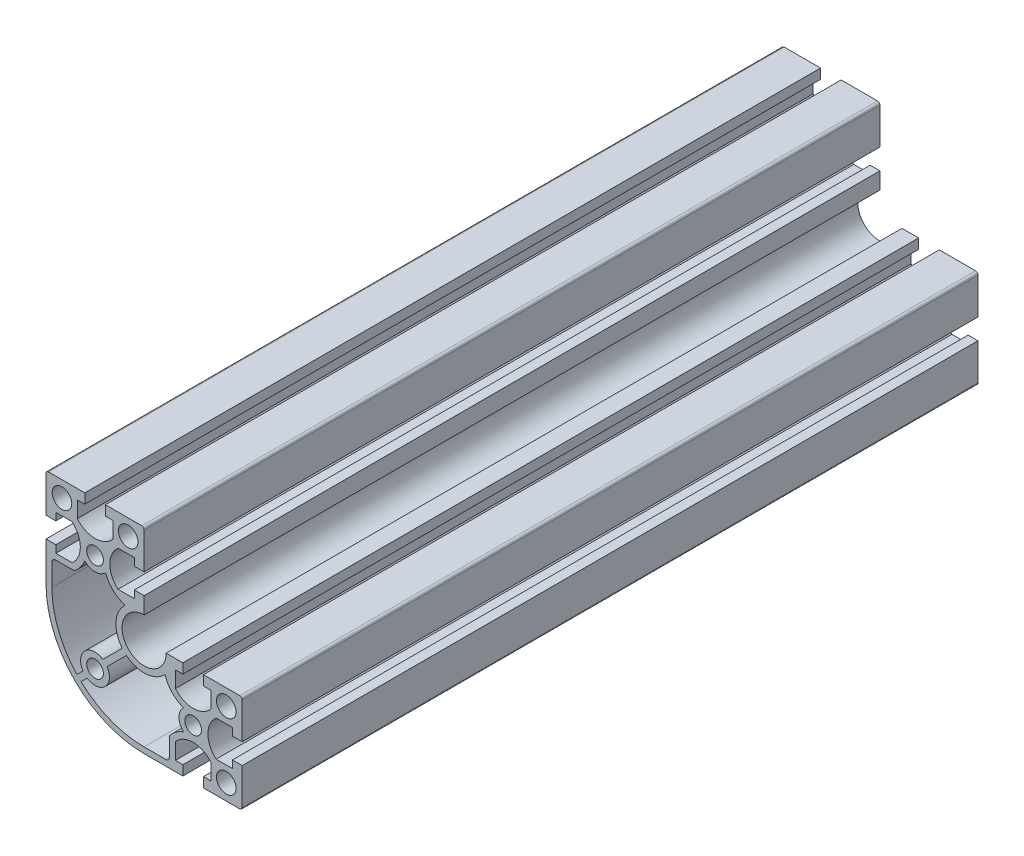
ISO-10303-21;
HEADER;
FILE_DESCRIPTION(('STEP AP214'),'2;1');
FILE_NAME('part.step','',(''),(''),'','','');
FILE_SCHEMA(('AUTOMOTIVE_DESIGN { 1 0 10303 214 1 1 1 1 }'));
ENDSEC;
DATA;
#1=APPLICATION_CONTEXT('core data for automotive mechanical design processes');
#2=APPLICATION_PROTOCOL_DEFINITION('international standard','automotive_design',2000,#1);
#3=PRODUCT_CONTEXT('',#1,'mechanical');
#4=PRODUCT('Part','Part','',(#3));
#5=PRODUCT_RELATED_PRODUCT_CATEGORY('part','',(#4));
#6=PRODUCT_DEFINITION_FORMATION('','',#4);
#7=PRODUCT_DEFINITION_CONTEXT('part definition',#1,'design');
#8=PRODUCT_DEFINITION('design','',#6,#7);
#9=PRODUCT_DEFINITION_SHAPE('','',#8);
#10=(LENGTH_UNIT() NAMED_UNIT(*) SI_UNIT(.MILLI.,.METRE.));
#11=(NAMED_UNIT(*) PLANE_ANGLE_UNIT() SI_UNIT($,.RADIAN.));
#12=(NAMED_UNIT(*) SI_UNIT($,.STERADIAN.) SOLID_ANGLE_UNIT());
#13=UNCERTAINTY_MEASURE_WITH_UNIT(LENGTH_MEASURE(1.E-05),#10,'distance_accuracy_value','');
#14=(GEOMETRIC_REPRESENTATION_CONTEXT(3) GLOBAL_UNCERTAINTY_ASSIGNED_CONTEXT((#13)) GLOBAL_UNIT_ASSIGNED_CONTEXT((#10,
#11,#12)) REPRESENTATION_CONTEXT('',''));
#15=CARTESIAN_POINT('',(0.,0.,0.));
#16=DIRECTION('',(0.,0.,1.));
#17=DIRECTION('',(1.,0.,0.));
#18=AXIS2_PLACEMENT_3D('',#15,#16,#17);
#19=CARTESIAN_POINT('',(39.,-0.99999999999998,150.));
#20=DIRECTION('',(0.,0.,1.));
#21=DIRECTION('',(1.,0.,0.));
#22=AXIS2_PLACEMENT_3D('',#19,#20,#21);
#23=PLANE('',#22);
#24=CARTESIAN_POINT('',(-33.5,33.5,150.));
#25=DIRECTION('',(0.,0.,1.));
#26=DIRECTION('',(1.,0.,0.));
#27=AXIS2_PLACEMENT_3D('',#24,#25,#26);
#28=CIRCLE('',#27,4.);
#29=CARTESIAN_POINT('',(-29.5,33.5,150.));
#30=VERTEX_POINT('',#29);
#31=EDGE_CURVE('E2243',#30,#30,#28,.T.);
#32=ORIENTED_EDGE('',*,*,#31,.F.);
#33=EDGE_LOOP('',(#32));
#34=FACE_BOUND('',#33,.T.);
#35=CARTESIAN_POINT('',(-6.5,33.5,150.));
#36=DIRECTION('',(0.,0.,1.));
#37=DIRECTION('',(1.,0.,0.));
#38=AXIS2_PLACEMENT_3D('',#35,#36,#37);
#39=CIRCLE('',#38,4.);
#40=CARTESIAN_POINT('',(-2.5,33.5,150.));
#41=VERTEX_POINT('',#40);
#42=EDGE_CURVE('E588',#41,#41,#39,.T.);
#43=ORIENTED_EDGE('',*,*,#42,.F.);
#44=EDGE_LOOP('',(#43));
#45=FACE_BOUND('',#44,.T.);
#46=DIRECTION('',(0.,1.,0.));
#47=VECTOR('',#46,1.);
#48=CARTESIAN_POINT('',(10.3499999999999,-36.0999999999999,150.));
#49=LINE('',#48,#47);
#50=CARTESIAN_POINT('',(10.3499999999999,-36.0999999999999,150.));
#51=VERTEX_POINT('',#50);
#52=CARTESIAN_POINT('',(10.35,-28.5367033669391,150.));
#53=VERTEX_POINT('',#52);
#54=EDGE_CURVE('E635',#51,#53,#49,.T.);
#55=ORIENTED_EDGE('',*,*,#54,.F.);
#56=CARTESIAN_POINT('',(8.84999999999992,-36.0999999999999,150.));
#57=DIRECTION('',(0.,0.,1.));
#58=DIRECTION('',(1.,0.,0.));
#59=AXIS2_PLACEMENT_3D('',#56,#57,#58);
#60=CIRCLE('',#59,1.5);
#61=CARTESIAN_POINT('',(8.84999999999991,-37.5999999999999,150.));
#62=VERTEX_POINT('',#61);
#63=EDGE_CURVE('E633',#62,#51,#60,.T.);
#64=ORIENTED_EDGE('',*,*,#63,.F.);
#65=DIRECTION('',(1.,0.,0.));
#66=VECTOR('',#65,1.);
#67=CARTESIAN_POINT('',(0.,-37.5999999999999,150.));
#68=LINE('',#67,#66);
#69=CARTESIAN_POINT('',(0.,-37.5999999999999,150.));
#70=VERTEX_POINT('',#69);
#71=EDGE_CURVE('E655',#70,#62,#68,.T.);
#72=ORIENTED_EDGE('',*,*,#71,.F.);
#73=CARTESIAN_POINT('',(0.,0.,150.));
#74=DIRECTION('',(0.,0.,1.));
#75=DIRECTION('',(1.,0.,0.));
#76=AXIS2_PLACEMENT_3D('',#73,#74,#75);
#77=CIRCLE('',#76,37.5999999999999);
#78=CARTESIAN_POINT('',(-25.7251430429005,-27.422199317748,150.));
#79=VERTEX_POINT('',#78);
#80=EDGE_CURVE('E652',#79,#70,#77,.T.);
#81=ORIENTED_EDGE('',*,*,#80,.F.);
#82=DIRECTION('',(-0.707106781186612,-0.707106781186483,0.));
#83=VECTOR('',#82,1.);
#84=CARTESIAN_POINT('',(-23.2361995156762,-24.9332557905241,150.));
#85=LINE('',#84,#83);
#86=CARTESIAN_POINT('',(-23.2361995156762,-24.9332557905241,150.));
#87=VERTEX_POINT('',#86);
#88=EDGE_CURVE('E650',#87,#79,#85,.T.);
#89=ORIENTED_EDGE('',*,*,#88,.F.);
#90=CARTESIAN_POINT('',(-19.9999999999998,-20.0000000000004,150.));
#91=DIRECTION('',(0.,0.,-1.));
#92=DIRECTION('',(1.,0.,0.));
#93=AXIS2_PLACEMENT_3D('',#90,#91,#92);
#94=CIRCLE('',#93,5.89999999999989);
#95=CARTESIAN_POINT('',(-15.0667442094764,-16.7638004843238,150.));
#96=VERTEX_POINT('',#95);
#97=EDGE_CURVE('E648',#96,#87,#94,.T.);
#98=ORIENTED_EDGE('',*,*,#97,.F.);
#99=DIRECTION('',(-0.707106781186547,-0.707106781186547,0.));
#100=VECTOR('',#99,1.);
#101=CARTESIAN_POINT('',(-7.2388076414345,-8.93586391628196,150.));
#102=LINE('',#101,#100);
#103=CARTESIAN_POINT('',(-7.2388076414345,-8.93586391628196,150.));
#104=VERTEX_POINT('',#103);
#105=EDGE_CURVE('E646',#104,#96,#102,.T.);
#106=ORIENTED_EDGE('',*,*,#105,.F.);
#107=CARTESIAN_POINT('',(0.,0.,150.));
#108=DIRECTION('',(0.,0.,-1.));
#109=DIRECTION('',(1.,0.,0.));
#110=AXIS2_PLACEMENT_3D('',#107,#108,#109);
#111=CIRCLE('',#110,11.5000000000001);
#112=CARTESIAN_POINT('',(8.53911412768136,-7.70282609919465,150.));
#113=VERTEX_POINT('',#112);
#114=EDGE_CURVE('E644',#113,#104,#111,.T.);
#115=ORIENTED_EDGE('',*,*,#114,.F.);
#116=CARTESIAN_POINT('',(20.,-4.50000000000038,150.));
#117=DIRECTION('',(0.,0.,-1.));
#118=DIRECTION('',(1.,0.,0.));
#119=AXIS2_PLACEMENT_3D('',#116,#117,#118);
#120=CIRCLE('',#119,11.8999999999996);
#121=CARTESIAN_POINT('',(16.0716561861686,-15.7329032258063,150.));
#122=VERTEX_POINT('',#121);
#123=EDGE_CURVE('E642',#122,#113,#120,.T.);
#124=ORIENTED_EDGE('',*,*,#123,.F.);
#125=CARTESIAN_POINT('',(20.,-20.,150.));
#126=DIRECTION('',(0.,0.,-1.));
#127=DIRECTION('',(1.,0.,0.));
#128=AXIS2_PLACEMENT_3D('',#125,#126,#127);
#129=CIRCLE('',#128,5.80000000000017);
#130=CARTESIAN_POINT('',(16.0716561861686,-24.2670967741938,150.));
#131=VERTEX_POINT('',#130);
#132=EDGE_CURVE('E640',#131,#122,#129,.T.);
#133=ORIENTED_EDGE('',*,*,#132,.F.);
#134=CARTESIAN_POINT('',(20.,-35.4999999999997,150.));
#135=DIRECTION('',(0.,0.,-1.));
#136=DIRECTION('',(1.,0.,0.));
#137=AXIS2_PLACEMENT_3D('',#134,#135,#136);
#138=CIRCLE('',#137,11.8999999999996);
#139=EDGE_CURVE('E638',#53,#131,#138,.T.);
#140=ORIENTED_EDGE('',*,*,#139,.F.);
#141=EDGE_LOOP('',(#55,#64,#72,#81,#89,#98,#106,#115,#124,#133,#140));
#142=FACE_BOUND('',#141,.T.);
#143=CARTESIAN_POINT('',(33.5,-33.5,150.));
#144=DIRECTION('',(0.,0.,1.));
#145=DIRECTION('',(1.,0.,0.));
#146=AXIS2_PLACEMENT_3D('',#143,#144,#145);
#147=CIRCLE('',#146,4.);
#148=CARTESIAN_POINT('',(37.5,-33.5,150.));
#149=VERTEX_POINT('',#148);
#150=EDGE_CURVE('E719',#149,#149,#147,.T.);
#151=ORIENTED_EDGE('',*,*,#150,.F.);
#152=EDGE_LOOP('',(#151));
#153=FACE_BOUND('',#152,.T.);
#154=DIRECTION('',(0.,-1.,0.));
#155=VECTOR('',#154,1.);
#156=CARTESIAN_POINT('',(36.,-12.75,150.));
#157=LINE('',#156,#155);
#158=CARTESIAN_POINT('',(36.,-12.75,150.));
#159=VERTEX_POINT('',#158);
#160=CARTESIAN_POINT('',(36.,-15.8000000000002,150.));
#161=VERTEX_POINT('',#160);
#162=EDGE_CURVE('E731',#159,#161,#157,.T.);
#163=ORIENTED_EDGE('',*,*,#162,.T.);
#164=DIRECTION('',(1.,0.,0.));
#165=VECTOR('',#164,1.);
#166=CARTESIAN_POINT('',(36.,-15.8000000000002,150.));
#167=LINE('',#166,#165);
#168=CARTESIAN_POINT('',(40.,-15.8000000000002,150.));
#169=VERTEX_POINT('',#168);
#170=EDGE_CURVE('E734',#161,#169,#167,.T.);
#171=ORIENTED_EDGE('',*,*,#170,.T.);
#172=DIRECTION('',(0.,1.,0.));
#173=VECTOR('',#172,1.);
#174=CARTESIAN_POINT('',(40.,-15.8000000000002,150.));
#175=LINE('',#174,#173);
#176=CARTESIAN_POINT('',(40.,-1.,150.));
#177=VERTEX_POINT('',#176);
#178=EDGE_CURVE('E737',#169,#177,#175,.T.);
#179=ORIENTED_EDGE('',*,*,#178,.T.);
#180=CARTESIAN_POINT('',(39.,-0.99999999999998,150.));
#181=DIRECTION('',(0.,0.,1.));
#182=DIRECTION('',(1.,0.,0.));
#183=AXIS2_PLACEMENT_3D('',#180,#181,#182);
#184=CIRCLE('',#183,0.999999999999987);
#185=CARTESIAN_POINT('',(39.,0.,150.));
#186=VERTEX_POINT('',#185);
#187=EDGE_CURVE('E739',#177,#186,#184,.T.);
#188=ORIENTED_EDGE('',*,*,#187,.T.);
#189=DIRECTION('',(-1.,0.,0.));
#190=VECTOR('',#189,1.);
#191=CARTESIAN_POINT('',(39.,0.,150.));
#192=LINE('',#191,#190);
#193=CARTESIAN_POINT('',(24.2000000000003,0.,150.));
#194=VERTEX_POINT('',#193);
#195=EDGE_CURVE('E741',#186,#194,#192,.T.);
#196=ORIENTED_EDGE('',*,*,#195,.T.);
#197=DIRECTION('',(0.,-1.,0.));
#198=VECTOR('',#197,1.);
#199=CARTESIAN_POINT('',(24.2000000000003,0.,150.));
#200=LINE('',#199,#198);
#201=CARTESIAN_POINT('',(24.2000000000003,-4.,150.));
#202=VERTEX_POINT('',#201);
#203=EDGE_CURVE('E743',#194,#202,#200,.T.);
#204=ORIENTED_EDGE('',*,*,#203,.T.);
#205=DIRECTION('',(1.,0.,0.));
#206=VECTOR('',#205,1.);
#207=CARTESIAN_POINT('',(24.2000000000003,-4.,150.));
#208=LINE('',#207,#206);
#209=CARTESIAN_POINT('',(27.25,-4.,150.));
#210=VERTEX_POINT('',#209);
#211=EDGE_CURVE('E745',#202,#210,#208,.T.);
#212=ORIENTED_EDGE('',*,*,#211,.T.);
#213=DIRECTION('',(0.,-1.,0.));
#214=VECTOR('',#213,1.);
#215=CARTESIAN_POINT('',(27.25,-4.,150.));
#216=LINE('',#215,#214);
#217=CARTESIAN_POINT('',(27.25,-10.6390145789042,150.));
#218=VERTEX_POINT('',#217);
#219=EDGE_CURVE('E747',#210,#218,#216,.T.);
#220=ORIENTED_EDGE('',*,*,#219,.T.);
#221=CARTESIAN_POINT('',(20.,-4.50000000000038,150.));
#222=DIRECTION('',(0.,0.,-1.));
#223=DIRECTION('',(1.,0.,0.));
#224=AXIS2_PLACEMENT_3D('',#221,#222,#223);
#225=CIRCLE('',#224,9.49999999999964);
#226=CARTESIAN_POINT('',(12.75,-10.6390145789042,150.));
#227=VERTEX_POINT('',#226);
#228=EDGE_CURVE('E749',#218,#227,#225,.T.);
#229=ORIENTED_EDGE('',*,*,#228,.T.);
#230=DIRECTION('',(0.,1.,0.));
#231=VECTOR('',#230,1.);
#232=CARTESIAN_POINT('',(12.75,-10.6390145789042,150.));
#233=LINE('',#232,#231);
#234=CARTESIAN_POINT('',(12.75,-4.,150.));
#235=VERTEX_POINT('',#234);
#236=EDGE_CURVE('E751',#227,#235,#233,.T.);
#237=ORIENTED_EDGE('',*,*,#236,.T.);
#238=DIRECTION('',(1.,0.,0.));
#239=VECTOR('',#238,1.);
#240=CARTESIAN_POINT('',(12.75,-4.,150.));
#241=LINE('',#240,#239);
#242=CARTESIAN_POINT('',(15.8000000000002,-4.,150.));
#243=VERTEX_POINT('',#242);
#244=EDGE_CURVE('E753',#235,#243,#241,.T.);
#245=ORIENTED_EDGE('',*,*,#244,.T.);
#246=DIRECTION('',(0.,1.,0.));
#247=VECTOR('',#246,1.);
#248=CARTESIAN_POINT('',(15.8000000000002,-4.,150.));
#249=LINE('',#248,#247);
#250=CARTESIAN_POINT('',(15.8000000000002,0.,150.));
#251=VERTEX_POINT('',#250);
#252=EDGE_CURVE('E755',#243,#251,#249,.T.);
#253=ORIENTED_EDGE('',*,*,#252,.T.);
#254=DIRECTION('',(-1.,0.,0.));
#255=VECTOR('',#254,1.);
#256=CARTESIAN_POINT('',(15.8000000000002,0.,150.));
#257=LINE('',#256,#255);
#258=CARTESIAN_POINT('',(9.,0.,150.));
#259=VERTEX_POINT('',#258);
#260=EDGE_CURVE('E757',#251,#259,#257,.T.);
#261=ORIENTED_EDGE('',*,*,#260,.T.);
#262=CARTESIAN_POINT('',(0.,0.,150.));
#263=DIRECTION('',(0.,0.,-1.));
#264=DIRECTION('',(1.,0.,0.));
#265=AXIS2_PLACEMENT_3D('',#262,#263,#264);
#266=CIRCLE('',#265,9.);
#267=CARTESIAN_POINT('',(0.,9.,150.));
#268=VERTEX_POINT('',#267);
#269=EDGE_CURVE('E759',#259,#268,#266,.T.);
#270=ORIENTED_EDGE('',*,*,#269,.T.);
#271=DIRECTION('',(0.,1.,0.));
#272=VECTOR('',#271,1.);
#273=CARTESIAN_POINT('',(0.,9.,150.));
#274=LINE('',#273,#272);
#275=CARTESIAN_POINT('',(0.,15.8000000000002,150.));
#276=VERTEX_POINT('',#275);
#277=EDGE_CURVE('E761',#268,#276,#274,.T.);
#278=ORIENTED_EDGE('',*,*,#277,.T.);
#279=DIRECTION('',(-1.,0.,0.));
#280=VECTOR('',#279,1.);
#281=CARTESIAN_POINT('',(0.,15.8000000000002,150.));
#282=LINE('',#281,#280);
#283=CARTESIAN_POINT('',(-4.,15.8000000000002,150.));
#284=VERTEX_POINT('',#283);
#285=EDGE_CURVE('E763',#276,#284,#282,.T.);
#286=ORIENTED_EDGE('',*,*,#285,.T.);
#287=DIRECTION('',(0.,-1.,0.));
#288=VECTOR('',#287,1.);
#289=CARTESIAN_POINT('',(-4.,15.8000000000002,150.));
#290=LINE('',#289,#288);
#291=CARTESIAN_POINT('',(-4.,12.75,150.));
#292=VERTEX_POINT('',#291);
#293=EDGE_CURVE('E765',#284,#292,#290,.T.);
#294=ORIENTED_EDGE('',*,*,#293,.T.);
#295=DIRECTION('',(-1.,0.,0.));
#296=VECTOR('',#295,1.);
#297=CARTESIAN_POINT('',(-4.,12.75,150.));
#298=LINE('',#297,#296);
#299=CARTESIAN_POINT('',(-10.6390145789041,12.75,150.));
#300=VERTEX_POINT('',#299);
#301=EDGE_CURVE('E767',#292,#300,#298,.T.);
#302=ORIENTED_EDGE('',*,*,#301,.T.);
#303=CARTESIAN_POINT('',(-4.5000000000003,20.,150.));
#304=DIRECTION('',(0.,0.,-1.));
#305=DIRECTION('',(1.,0.,0.));
#306=AXIS2_PLACEMENT_3D('',#303,#304,#305);
#307=CIRCLE('',#306,9.49999999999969);
#308=CARTESIAN_POINT('',(-10.6390145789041,27.25,150.));
#309=VERTEX_POINT('',#308);
#310=EDGE_CURVE('E769',#300,#309,#307,.T.);
#311=ORIENTED_EDGE('',*,*,#310,.T.);
#312=DIRECTION('',(1.,0.,0.));
#313=VECTOR('',#312,1.);
#314=CARTESIAN_POINT('',(-10.6390145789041,27.25,150.));
#315=LINE('',#314,#313);
#316=CARTESIAN_POINT('',(-4.,27.25,150.));
#317=VERTEX_POINT('',#316);
#318=EDGE_CURVE('E771',#309,#317,#315,.T.);
#319=ORIENTED_EDGE('',*,*,#318,.T.);
#320=DIRECTION('',(0.,-1.,0.));
#321=VECTOR('',#320,1.);
#322=CARTESIAN_POINT('',(-4.,27.25,150.));
#323=LINE('',#322,#321);
#324=CARTESIAN_POINT('',(-4.,24.2000000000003,150.));
#325=VERTEX_POINT('',#324);
#326=EDGE_CURVE('E773',#317,#325,#323,.T.);
#327=ORIENTED_EDGE('',*,*,#326,.T.);
#328=DIRECTION('',(1.,0.,0.));
#329=VECTOR('',#328,1.);
#330=CARTESIAN_POINT('',(-4.,24.2000000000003,150.));
#331=LINE('',#330,#329);
#332=CARTESIAN_POINT('',(0.,24.2000000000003,150.));
#333=VERTEX_POINT('',#332);
#334=EDGE_CURVE('E775',#325,#333,#331,.T.);
#335=ORIENTED_EDGE('',*,*,#334,.T.);
#336=DIRECTION('',(0.,1.,0.));
#337=VECTOR('',#336,1.);
#338=CARTESIAN_POINT('',(0.,24.2000000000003,150.));
#339=LINE('',#338,#337);
#340=CARTESIAN_POINT('',(0.,39.,150.));
#341=VERTEX_POINT('',#340);
#342=EDGE_CURVE('E777',#333,#341,#339,.T.);
#343=ORIENTED_EDGE('',*,*,#342,.T.);
#344=CARTESIAN_POINT('',(-0.999999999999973,39.,150.));
#345=DIRECTION('',(0.,0.,1.));
#346=DIRECTION('',(1.,0.,0.));
#347=AXIS2_PLACEMENT_3D('',#344,#345,#346);
#348=CIRCLE('',#347,0.999999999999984);
#349=CARTESIAN_POINT('',(-0.999999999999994,40.,150.));
#350=VERTEX_POINT('',#349);
#351=EDGE_CURVE('E779',#341,#350,#348,.T.);
#352=ORIENTED_EDGE('',*,*,#351,.T.);
#353=DIRECTION('',(-1.,0.,0.));
#354=VECTOR('',#353,1.);
#355=CARTESIAN_POINT('',(-0.999999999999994,40.,150.));
#356=LINE('',#355,#354);
#357=CARTESIAN_POINT('',(-15.7999999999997,40.,150.));
#358=VERTEX_POINT('',#357);
#359=EDGE_CURVE('E781',#350,#358,#356,.T.);
#360=ORIENTED_EDGE('',*,*,#359,.T.);
#361=DIRECTION('',(0.,-1.,0.));
#362=VECTOR('',#361,1.);
#363=CARTESIAN_POINT('',(-15.7999999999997,40.,150.));
#364=LINE('',#363,#362);
#365=CARTESIAN_POINT('',(-15.7999999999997,36.,150.));
#366=VERTEX_POINT('',#365);
#367=EDGE_CURVE('E783',#358,#366,#364,.T.);
#368=ORIENTED_EDGE('',*,*,#367,.T.);
#369=DIRECTION('',(1.,0.,0.));
#370=VECTOR('',#369,1.);
#371=CARTESIAN_POINT('',(-15.7999999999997,36.,150.));
#372=LINE('',#371,#370);
#373=CARTESIAN_POINT('',(-12.75,36.,150.));
#374=VERTEX_POINT('',#373);
#375=EDGE_CURVE('E785',#366,#374,#372,.T.);
#376=ORIENTED_EDGE('',*,*,#375,.T.);
#377=DIRECTION('',(0.,-1.,0.));
#378=VECTOR('',#377,1.);
#379=CARTESIAN_POINT('',(-12.75,36.,150.));
#380=LINE('',#379,#378);
#381=CARTESIAN_POINT('',(-12.75,29.3609854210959,150.));
#382=VERTEX_POINT('',#381);
#383=EDGE_CURVE('E787',#374,#382,#380,.T.);
#384=ORIENTED_EDGE('',*,*,#383,.T.);
#385=CARTESIAN_POINT('',(-20.,35.4999999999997,150.));
#386=DIRECTION('',(0.,0.,-1.));
#387=DIRECTION('',(1.,0.,0.));
#388=AXIS2_PLACEMENT_3D('',#385,#386,#387);
#389=CIRCLE('',#388,9.49999999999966);
#390=CARTESIAN_POINT('',(-27.25,29.3609854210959,150.));
#391=VERTEX_POINT('',#390);
#392=EDGE_CURVE('E789',#382,#391,#389,.T.);
#393=ORIENTED_EDGE('',*,*,#392,.T.);
#394=DIRECTION('',(0.,1.,0.));
#395=VECTOR('',#394,1.);
#396=CARTESIAN_POINT('',(-27.25,29.3609854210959,150.));
#397=LINE('',#396,#395);
#398=CARTESIAN_POINT('',(-27.25,36.,150.));
#399=VERTEX_POINT('',#398);
#400=EDGE_CURVE('E791',#391,#399,#397,.T.);
#401=ORIENTED_EDGE('',*,*,#400,.T.);
#402=DIRECTION('',(1.,0.,0.));
#403=VECTOR('',#402,1.);
#404=CARTESIAN_POINT('',(-27.25,36.,150.));
#405=LINE('',#404,#403);
#406=CARTESIAN_POINT('',(-24.1999999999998,36.,150.));
#407=VERTEX_POINT('',#406);
#408=EDGE_CURVE('E793',#399,#407,#405,.T.);
#409=ORIENTED_EDGE('',*,*,#408,.T.);
#410=DIRECTION('',(0.,1.,0.));
#411=VECTOR('',#410,1.);
#412=CARTESIAN_POINT('',(-24.1999999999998,36.,150.));
#413=LINE('',#412,#411);
#414=CARTESIAN_POINT('',(-24.1999999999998,40.,150.));
#415=VERTEX_POINT('',#414);
#416=EDGE_CURVE('E795',#407,#415,#413,.T.);
#417=ORIENTED_EDGE('',*,*,#416,.T.);
#418=DIRECTION('',(-1.,0.,0.));
#419=VECTOR('',#418,1.);
#420=CARTESIAN_POINT('',(-24.1999999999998,40.,150.));
#421=LINE('',#420,#419);
#422=CARTESIAN_POINT('',(-39.,40.,150.));
#423=VERTEX_POINT('',#422);
#424=EDGE_CURVE('E797',#415,#423,#421,.T.);
#425=ORIENTED_EDGE('',*,*,#424,.T.);
#426=CARTESIAN_POINT('',(-39.,39.,150.));
#427=DIRECTION('',(0.,0.,1.));
#428=DIRECTION('',(1.,0.,0.));
#429=AXIS2_PLACEMENT_3D('',#426,#427,#428);
#430=CIRCLE('',#429,0.999999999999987);
#431=CARTESIAN_POINT('',(-40.,39.,150.));
#432=VERTEX_POINT('',#431);
#433=EDGE_CURVE('E799',#423,#432,#430,.T.);
#434=ORIENTED_EDGE('',*,*,#433,.T.);
#435=DIRECTION('',(0.,-1.,0.));
#436=VECTOR('',#435,1.);
#437=CARTESIAN_POINT('',(-40.,39.,150.));
#438=LINE('',#437,#436);
#439=CARTESIAN_POINT('',(-40.,24.2000000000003,150.));
#440=VERTEX_POINT('',#439);
#441=EDGE_CURVE('E801',#432,#440,#438,.T.);
#442=ORIENTED_EDGE('',*,*,#441,.T.);
#443=DIRECTION('',(1.,0.,0.));
#444=VECTOR('',#443,1.);
#445=CARTESIAN_POINT('',(-40.,24.2000000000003,150.));
#446=LINE('',#445,#444);
#447=CARTESIAN_POINT('',(-36.,24.2000000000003,150.));
#448=VERTEX_POINT('',#447);
#449=EDGE_CURVE('E803',#440,#448,#446,.T.);
#450=ORIENTED_EDGE('',*,*,#449,.T.);
#451=DIRECTION('',(0.,1.,0.));
#452=VECTOR('',#451,1.);
#453=CARTESIAN_POINT('',(-36.,24.2000000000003,150.));
#454=LINE('',#453,#452);
#455=CARTESIAN_POINT('',(-36.,27.25,150.));
#456=VERTEX_POINT('',#455);
#457=EDGE_CURVE('E805',#448,#456,#454,.T.);
#458=ORIENTED_EDGE('',*,*,#457,.T.);
#459=DIRECTION('',(1.,0.,0.));
#460=VECTOR('',#459,1.);
#461=CARTESIAN_POINT('',(-36.,27.25,150.));
#462=LINE('',#461,#460);
#463=CARTESIAN_POINT('',(-29.3609854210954,27.25,150.));
#464=VERTEX_POINT('',#463);
#465=EDGE_CURVE('E807',#456,#464,#462,.T.);
#466=ORIENTED_EDGE('',*,*,#465,.T.);
#467=CARTESIAN_POINT('',(-35.4999999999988,20.0000000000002,150.));
#468=DIRECTION('',(0.,0.,-1.));
#469=DIRECTION('',(1.,0.,0.));
#470=AXIS2_PLACEMENT_3D('',#467,#468,#469);
#471=CIRCLE('',#470,9.49999999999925);
#472=CARTESIAN_POINT('',(-29.3609854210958,12.75,150.));
#473=VERTEX_POINT('',#472);
#474=EDGE_CURVE('E809',#464,#473,#471,.T.);
#475=ORIENTED_EDGE('',*,*,#474,.T.);
#476=DIRECTION('',(-1.,0.,0.));
#477=VECTOR('',#476,1.);
#478=CARTESIAN_POINT('',(-29.3609854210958,12.75,150.));
#479=LINE('',#478,#477);
#480=CARTESIAN_POINT('',(-36.,12.75,150.));
#481=VERTEX_POINT('',#480);
#482=EDGE_CURVE('E811',#473,#481,#479,.T.);
#483=ORIENTED_EDGE('',*,*,#482,.T.);
#484=DIRECTION('',(0.,1.,0.));
#485=VECTOR('',#484,1.);
#486=CARTESIAN_POINT('',(-36.,12.75,150.));
#487=LINE('',#486,#485);
#488=CARTESIAN_POINT('',(-36.,15.8000000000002,150.));
#489=VERTEX_POINT('',#488);
#490=EDGE_CURVE('E813',#481,#489,#487,.T.);
#491=ORIENTED_EDGE('',*,*,#490,.T.);
#492=DIRECTION('',(-1.,0.,0.));
#493=VECTOR('',#492,1.);
#494=CARTESIAN_POINT('',(-36.,15.8000000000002,150.));
#495=LINE('',#494,#493);
#496=CARTESIAN_POINT('',(-40.,15.8000000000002,150.));
#497=VERTEX_POINT('',#496);
#498=EDGE_CURVE('E815',#489,#497,#495,.T.);
#499=ORIENTED_EDGE('',*,*,#498,.T.);
#500=DIRECTION('',(0.,-1.,0.));
#501=VECTOR('',#500,1.);
#502=CARTESIAN_POINT('',(-40.,15.8000000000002,150.));
#503=LINE('',#502,#501);
#504=CARTESIAN_POINT('',(-40.,0.,150.));
#505=VERTEX_POINT('',#504);
#506=EDGE_CURVE('E817',#497,#505,#503,.T.);
#507=ORIENTED_EDGE('',*,*,#506,.T.);
#508=CARTESIAN_POINT('',(0.,0.,150.));
#509=DIRECTION('',(0.,0.,1.));
#510=DIRECTION('',(1.,0.,0.));
#511=AXIS2_PLACEMENT_3D('',#508,#509,#510);
#512=CIRCLE('',#511,40.);
#513=CARTESIAN_POINT('',(0.,-40.,150.));
#514=VERTEX_POINT('',#513);
#515=EDGE_CURVE('E819',#505,#514,#512,.T.);
#516=ORIENTED_EDGE('',*,*,#515,.T.);
#517=DIRECTION('',(1.,0.,0.));
#518=VECTOR('',#517,1.);
#519=CARTESIAN_POINT('',(0.,-40.,150.));
#520=LINE('',#519,#518);
#521=CARTESIAN_POINT('',(15.8000000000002,-40.,150.));
#522=VERTEX_POINT('',#521);
#523=EDGE_CURVE('E821',#514,#522,#520,.T.);
#524=ORIENTED_EDGE('',*,*,#523,.T.);
#525=DIRECTION('',(0.,1.,0.));
#526=VECTOR('',#525,1.);
#527=CARTESIAN_POINT('',(15.8000000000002,-40.,150.));
#528=LINE('',#527,#526);
#529=CARTESIAN_POINT('',(15.8000000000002,-36.,150.));
#530=VERTEX_POINT('',#529);
#531=EDGE_CURVE('E823',#522,#530,#528,.T.);
#532=ORIENTED_EDGE('',*,*,#531,.T.);
#533=DIRECTION('',(-1.,0.,0.));
#534=VECTOR('',#533,1.);
#535=CARTESIAN_POINT('',(15.8000000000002,-36.,150.));
#536=LINE('',#535,#534);
#537=CARTESIAN_POINT('',(12.75,-36.,150.));
#538=VERTEX_POINT('',#537);
#539=EDGE_CURVE('E825',#530,#538,#536,.T.);
#540=ORIENTED_EDGE('',*,*,#539,.T.);
#541=DIRECTION('',(0.,1.,0.));
#542=VECTOR('',#541,1.);
#543=CARTESIAN_POINT('',(12.75,-36.,150.));
#544=LINE('',#543,#542);
#545=CARTESIAN_POINT('',(12.75,-29.3609854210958,150.));
#546=VERTEX_POINT('',#545);
#547=EDGE_CURVE('E827',#538,#546,#544,.T.);
#548=ORIENTED_EDGE('',*,*,#547,.T.);
#549=CARTESIAN_POINT('',(20.,-35.4999999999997,150.));
#550=DIRECTION('',(0.,0.,-1.));
#551=DIRECTION('',(1.,0.,0.));
#552=AXIS2_PLACEMENT_3D('',#549,#550,#551);
#553=CIRCLE('',#552,9.49999999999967);
#554=CARTESIAN_POINT('',(27.25,-29.3609854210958,150.));
#555=VERTEX_POINT('',#554);
#556=EDGE_CURVE('E829',#546,#555,#553,.T.);
#557=ORIENTED_EDGE('',*,*,#556,.T.);
#558=DIRECTION('',(0.,-1.,0.));
#559=VECTOR('',#558,1.);
#560=CARTESIAN_POINT('',(27.25,-29.3609854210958,150.));
#561=LINE('',#560,#559);
#562=CARTESIAN_POINT('',(27.25,-36.,150.));
#563=VERTEX_POINT('',#562);
#564=EDGE_CURVE('E831',#555,#563,#561,.T.);
#565=ORIENTED_EDGE('',*,*,#564,.T.);
#566=DIRECTION('',(-1.,0.,0.));
#567=VECTOR('',#566,1.);
#568=CARTESIAN_POINT('',(27.25,-36.,150.));
#569=LINE('',#568,#567);
#570=CARTESIAN_POINT('',(24.1999999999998,-36.,150.));
#571=VERTEX_POINT('',#570);
#572=EDGE_CURVE('E833',#563,#571,#569,.T.);
#573=ORIENTED_EDGE('',*,*,#572,.T.);
#574=DIRECTION('',(0.,-1.,0.));
#575=VECTOR('',#574,1.);
#576=CARTESIAN_POINT('',(24.1999999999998,-36.,150.));
#577=LINE('',#576,#575);
#578=CARTESIAN_POINT('',(24.1999999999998,-40.,150.));
#579=VERTEX_POINT('',#578);
#580=EDGE_CURVE('E835',#571,#579,#577,.T.);
#581=ORIENTED_EDGE('',*,*,#580,.T.);
#582=DIRECTION('',(1.,0.,0.));
#583=VECTOR('',#582,1.);
#584=CARTESIAN_POINT('',(24.1999999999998,-40.,150.));
#585=LINE('',#584,#583);
#586=CARTESIAN_POINT('',(39.,-40.,150.));
#587=VERTEX_POINT('',#586);
#588=EDGE_CURVE('E837',#579,#587,#585,.T.);
#589=ORIENTED_EDGE('',*,*,#588,.T.);
#590=CARTESIAN_POINT('',(39.,-39.,150.));
#591=DIRECTION('',(0.,0.,1.));
#592=DIRECTION('',(1.,0.,0.));
#593=AXIS2_PLACEMENT_3D('',#590,#591,#592);
#594=CIRCLE('',#593,0.999999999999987);
#595=CARTESIAN_POINT('',(40.,-39.,150.));
#596=VERTEX_POINT('',#595);
#597=EDGE_CURVE('E839',#587,#596,#594,.T.);
#598=ORIENTED_EDGE('',*,*,#597,.T.);
#599=DIRECTION('',(0.,1.,0.));
#600=VECTOR('',#599,1.);
#601=CARTESIAN_POINT('',(40.,-39.,150.));
#602=LINE('',#601,#600);
#603=CARTESIAN_POINT('',(40.,-24.1999999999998,150.));
#604=VERTEX_POINT('',#603);
#605=EDGE_CURVE('E841',#596,#604,#602,.T.);
#606=ORIENTED_EDGE('',*,*,#605,.T.);
#607=DIRECTION('',(-1.,0.,0.));
#608=VECTOR('',#607,1.);
#609=CARTESIAN_POINT('',(40.,-24.1999999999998,150.));
#610=LINE('',#609,#608);
#611=CARTESIAN_POINT('',(36.,-24.1999999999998,150.));
#612=VERTEX_POINT('',#611);
#613=EDGE_CURVE('E843',#604,#612,#610,.T.);
#614=ORIENTED_EDGE('',*,*,#613,.T.);
#615=DIRECTION('',(0.,-1.,0.));
#616=VECTOR('',#615,1.);
#617=CARTESIAN_POINT('',(36.,-24.1999999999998,150.));
#618=LINE('',#617,#616);
#619=CARTESIAN_POINT('',(36.,-27.25,150.));
#620=VERTEX_POINT('',#619);
#621=EDGE_CURVE('E845',#612,#620,#618,.T.);
#622=ORIENTED_EDGE('',*,*,#621,.T.);
#623=DIRECTION('',(-1.,0.,0.));
#624=VECTOR('',#623,1.);
#625=CARTESIAN_POINT('',(36.,-27.25,150.));
#626=LINE('',#625,#624);
#627=CARTESIAN_POINT('',(29.3609854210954,-27.25,150.));
#628=VERTEX_POINT('',#627);
#629=EDGE_CURVE('E847',#620,#628,#626,.T.);
#630=ORIENTED_EDGE('',*,*,#629,.T.);
#631=CARTESIAN_POINT('',(35.4999999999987,-20.0000000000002,150.));
#632=DIRECTION('',(0.,0.,-1.));
#633=DIRECTION('',(1.,0.,0.));
#634=AXIS2_PLACEMENT_3D('',#631,#632,#633);
#635=CIRCLE('',#634,9.49999999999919);
#636=CARTESIAN_POINT('',(29.3609854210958,-12.75,150.));
#637=VERTEX_POINT('',#636);
#638=EDGE_CURVE('E849',#628,#637,#635,.T.);
#639=ORIENTED_EDGE('',*,*,#638,.T.);
#640=DIRECTION('',(1.,0.,0.));
#641=VECTOR('',#640,1.);
#642=CARTESIAN_POINT('',(29.3609854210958,-12.75,150.));
#643=LINE('',#642,#641);
#644=EDGE_CURVE('E851',#637,#159,#643,.T.);
#645=ORIENTED_EDGE('',*,*,#644,.T.);
#646=EDGE_LOOP('',(#163,#171,#179,#188,#196,#204,#212,#220,#229,#237,#245,#253,#261,#270,#278,
#286,#294,#302,#311,#319,#327,#335,#343,#352,#360,#368,#376,#384,#393,#401,#409,#417,#425,#434,
#442,#450,#458,#466,#475,#483,#491,#499,#507,#516,#524,#532,#540,#548,#557,#565,#573,#581,#589,
#598,#606,#614,#622,#630,#639,#645));
#647=FACE_BOUND('',#646,.T.);
#648=CARTESIAN_POINT('',(20.,-20.,150.));
#649=DIRECTION('',(0.,0.,1.));
#650=DIRECTION('',(1.,0.,0.));
#651=AXIS2_PLACEMENT_3D('',#648,#649,#650);
#652=CIRCLE('',#651,3.4);
#653=CARTESIAN_POINT('',(23.4,-20.,150.));
#654=VERTEX_POINT('',#653);
#655=EDGE_CURVE('E725',#654,#654,#652,.T.);
#656=ORIENTED_EDGE('',*,*,#655,.F.);
#657=EDGE_LOOP('',(#656));
#658=FACE_BOUND('',#657,.T.);
#659=CARTESIAN_POINT('',(33.5,-6.5,150.));
#660=DIRECTION('',(0.,0.,1.));
#661=DIRECTION('',(1.,0.,0.));
#662=AXIS2_PLACEMENT_3D('',#659,#660,#661);
#663=CIRCLE('',#662,4.);
#664=CARTESIAN_POINT('',(37.5,-6.5,150.));
#665=VERTEX_POINT('',#664);
#666=EDGE_CURVE('E713',#665,#665,#663,.T.);
#667=ORIENTED_EDGE('',*,*,#666,.F.);
#668=EDGE_LOOP('',(#667));
#669=FACE_BOUND('',#668,.T.);
#670=DIRECTION('',(-1.,0.,0.));
#671=VECTOR('',#670,1.);
#672=CARTESIAN_POINT('',(-28.536703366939,10.3499999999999,150.));
#673=LINE('',#672,#671);
#674=CARTESIAN_POINT('',(-28.536703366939,10.3499999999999,150.));
#675=VERTEX_POINT('',#674);
#676=CARTESIAN_POINT('',(-36.0999999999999,10.3499999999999,150.));
#677=VERTEX_POINT('',#676);
#678=EDGE_CURVE('E552',#675,#677,#673,.T.);
#679=ORIENTED_EDGE('',*,*,#678,.F.);
#680=CARTESIAN_POINT('',(-35.4999999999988,20.0000000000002,150.));
#681=DIRECTION('',(0.,0.,-1.));
#682=DIRECTION('',(1.,0.,0.));
#683=AXIS2_PLACEMENT_3D('',#680,#681,#682);
#684=CIRCLE('',#683,11.8999999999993);
#685=CARTESIAN_POINT('',(-24.2670967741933,16.0716561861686,150.));
#686=VERTEX_POINT('',#685);
#687=EDGE_CURVE('E544',#686,#675,#684,.T.);
#688=ORIENTED_EDGE('',*,*,#687,.F.);
#689=CARTESIAN_POINT('',(-20.,19.9999999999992,150.));
#690=DIRECTION('',(0.,0.,-1.));
#691=DIRECTION('',(1.,0.,0.));
#692=AXIS2_PLACEMENT_3D('',#689,#690,#691);
#693=CIRCLE('',#692,5.79999999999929);
#694=CARTESIAN_POINT('',(-15.7329032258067,16.0716561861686,150.));
#695=VERTEX_POINT('',#694);
#696=EDGE_CURVE('E585',#695,#686,#693,.T.);
#697=ORIENTED_EDGE('',*,*,#696,.F.);
#698=CARTESIAN_POINT('',(-4.5000000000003,20.,150.));
#699=DIRECTION('',(0.,0.,-1.));
#700=DIRECTION('',(1.,0.,0.));
#701=AXIS2_PLACEMENT_3D('',#698,#699,#700);
#702=CIRCLE('',#701,11.8999999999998);
#703=CARTESIAN_POINT('',(-7.7028260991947,8.53911412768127,150.));
#704=VERTEX_POINT('',#703);
#705=EDGE_CURVE('E583',#704,#695,#702,.T.);
#706=ORIENTED_EDGE('',*,*,#705,.F.);
#707=CARTESIAN_POINT('',(0.,0.,150.));
#708=DIRECTION('',(0.,0.,-1.));
#709=DIRECTION('',(1.,0.,0.));
#710=AXIS2_PLACEMENT_3D('',#707,#708,#709);
#711=CIRCLE('',#710,11.4999999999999);
#712=CARTESIAN_POINT('',(-8.9358639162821,-7.23880764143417,150.));
#713=VERTEX_POINT('',#712);
#714=EDGE_CURVE('E581',#713,#704,#711,.T.);
#715=ORIENTED_EDGE('',*,*,#714,.F.);
#716=DIRECTION('',(0.707106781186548,0.707106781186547,0.));
#717=VECTOR('',#716,1.);
#718=CARTESIAN_POINT('',(-16.7638004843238,-15.0667442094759,150.));
#719=LINE('',#718,#717);
#720=CARTESIAN_POINT('',(-16.7638004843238,-15.0667442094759,150.));
#721=VERTEX_POINT('',#720);
#722=EDGE_CURVE('E579',#721,#713,#719,.T.);
#723=ORIENTED_EDGE('',*,*,#722,.F.);
#724=CARTESIAN_POINT('',(-19.9999999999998,-20.0000000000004,150.));
#725=DIRECTION('',(0.,0.,-1.));
#726=DIRECTION('',(1.,0.,0.));
#727=AXIS2_PLACEMENT_3D('',#724,#725,#726);
#728=CIRCLE('',#727,5.90000000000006);
#729=CARTESIAN_POINT('',(-24.9332557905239,-23.2361995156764,150.));
#730=VERTEX_POINT('',#729);
#731=EDGE_CURVE('E577',#730,#721,#728,.T.);
#732=ORIENTED_EDGE('',*,*,#731,.F.);
#733=DIRECTION('',(0.707106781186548,0.707106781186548,0.));
#734=VECTOR('',#733,1.);
#735=CARTESIAN_POINT('',(-27.422199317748,-25.7251430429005,150.));
#736=LINE('',#735,#734);
#737=CARTESIAN_POINT('',(-27.422199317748,-25.7251430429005,150.));
#738=VERTEX_POINT('',#737);
#739=EDGE_CURVE('E575',#738,#730,#736,.T.);
#740=ORIENTED_EDGE('',*,*,#739,.F.);
#741=CARTESIAN_POINT('',(0.,0.,150.));
#742=DIRECTION('',(0.,0.,1.));
#743=DIRECTION('',(1.,0.,0.));
#744=AXIS2_PLACEMENT_3D('',#741,#742,#743);
#745=CIRCLE('',#744,37.5999999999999);
#746=CARTESIAN_POINT('',(-37.5999999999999,0.,150.));
#747=VERTEX_POINT('',#746);
#748=EDGE_CURVE('E573',#747,#738,#745,.T.);
#749=ORIENTED_EDGE('',*,*,#748,.F.);
#750=DIRECTION('',(0.,-1.,0.));
#751=VECTOR('',#750,1.);
#752=CARTESIAN_POINT('',(-37.5999999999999,8.84999999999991,150.));
#753=LINE('',#752,#751);
#754=CARTESIAN_POINT('',(-37.5999999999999,8.84999999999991,150.));
#755=VERTEX_POINT('',#754);
#756=EDGE_CURVE('E568',#755,#747,#753,.T.);
#757=ORIENTED_EDGE('',*,*,#756,.F.);
#758=CARTESIAN_POINT('',(-36.0999999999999,8.84999999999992,150.));
#759=DIRECTION('',(0.,0.,1.));
#760=DIRECTION('',(1.,0.,0.));
#761=AXIS2_PLACEMENT_3D('',#758,#759,#760);
#762=CIRCLE('',#761,1.49999999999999);
#763=EDGE_CURVE('E566',#677,#755,#762,.T.);
#764=ORIENTED_EDGE('',*,*,#763,.F.);
#765=EDGE_LOOP('',(#679,#688,#697,#706,#715,#723,#732,#740,#749,#757,#764));
#766=FACE_BOUND('',#765,.T.);
#767=CARTESIAN_POINT('',(-19.9999999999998,-20.0000000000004,150.));
#768=DIRECTION('',(0.,0.,1.));
#769=DIRECTION('',(1.,0.,0.));
#770=AXIS2_PLACEMENT_3D('',#767,#768,#769);
#771=CIRCLE('',#770,3.39999999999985);
#772=CARTESIAN_POINT('',(-16.6,-20.0000000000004,150.));
#773=VERTEX_POINT('',#772);
#774=EDGE_CURVE('E2249',#773,#773,#771,.T.);
#775=ORIENTED_EDGE('',*,*,#774,.F.);
#776=EDGE_LOOP('',(#775));
#777=FACE_BOUND('',#776,.T.);
#778=CARTESIAN_POINT('',(-20.,19.9999999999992,150.));
#779=DIRECTION('',(0.,0.,1.));
#780=DIRECTION('',(1.,0.,0.));
#781=AXIS2_PLACEMENT_3D('',#778,#779,#780);
#782=CIRCLE('',#781,3.4);
#783=CARTESIAN_POINT('',(-16.6,19.9999999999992,150.));
#784=VERTEX_POINT('',#783);
#785=EDGE_CURVE('E2234',#784,#784,#782,.T.);
#786=ORIENTED_EDGE('',*,*,#785,.F.);
#787=EDGE_LOOP('',(#786));
#788=FACE_BOUND('',#787,.T.);
#789=ADVANCED_FACE('F35',(#34,#45,#142,#153,#647,#658,#669,#766,#777,#788),#23,.T.);
#790=CARTESIAN_POINT('',(39.,-0.99999999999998,-150.));
#791=DIRECTION('',(0.,0.,1.));
#792=DIRECTION('',(1.,0.,0.));
#793=AXIS2_PLACEMENT_3D('',#790,#791,#792);
#794=PLANE('',#793);
#795=CARTESIAN_POINT('',(-33.5,33.5,-150.));
#796=DIRECTION('',(0.,0.,1.));
#797=DIRECTION('',(1.,0.,0.));
#798=AXIS2_PLACEMENT_3D('',#795,#796,#797);
#799=CIRCLE('',#798,4.);
#800=CARTESIAN_POINT('',(-29.5,33.5,-150.));
#801=VERTEX_POINT('',#800);
#802=EDGE_CURVE('E2240',#801,#801,#799,.T.);
#803=ORIENTED_EDGE('',*,*,#802,.T.);
#804=EDGE_LOOP('',(#803));
#805=FACE_BOUND('',#804,.T.);
#806=CARTESIAN_POINT('',(-6.5,33.5,-150.));
#807=DIRECTION('',(0.,0.,1.));
#808=DIRECTION('',(1.,0.,0.));
#809=AXIS2_PLACEMENT_3D('',#806,#807,#808);
#810=CIRCLE('',#809,4.);
#811=CARTESIAN_POINT('',(-2.5,33.5,-150.));
#812=VERTEX_POINT('',#811);
#813=EDGE_CURVE('E2252',#812,#812,#810,.T.);
#814=ORIENTED_EDGE('',*,*,#813,.T.);
#815=EDGE_LOOP('',(#814));
#816=FACE_BOUND('',#815,.T.);
#817=CARTESIAN_POINT('',(8.84999999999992,-36.0999999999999,-150.));
#818=DIRECTION('',(0.,0.,1.));
#819=DIRECTION('',(1.,0.,0.));
#820=AXIS2_PLACEMENT_3D('',#817,#818,#819);
#821=CIRCLE('',#820,1.5);
#822=CARTESIAN_POINT('',(8.84999999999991,-37.5999999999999,-150.));
#823=VERTEX_POINT('',#822);
#824=CARTESIAN_POINT('',(10.3499999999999,-36.0999999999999,-150.));
#825=VERTEX_POINT('',#824);
#826=EDGE_CURVE('E560',#823,#825,#821,.T.);
#827=ORIENTED_EDGE('',*,*,#826,.T.);
#828=DIRECTION('',(0.,1.,0.));
#829=VECTOR('',#828,1.);
#830=CARTESIAN_POINT('',(10.3499999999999,-36.0999999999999,-150.));
#831=LINE('',#830,#829);
#832=CARTESIAN_POINT('',(10.35,-28.5367033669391,-150.));
#833=VERTEX_POINT('',#832);
#834=EDGE_CURVE('E660',#825,#833,#831,.T.);
#835=ORIENTED_EDGE('',*,*,#834,.T.);
#836=CARTESIAN_POINT('',(20.,-35.4999999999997,-150.));
#837=DIRECTION('',(0.,0.,-1.));
#838=DIRECTION('',(1.,0.,0.));
#839=AXIS2_PLACEMENT_3D('',#836,#837,#838);
#840=CIRCLE('',#839,11.8999999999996);
#841=CARTESIAN_POINT('',(16.0716561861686,-24.2670967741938,-150.));
#842=VERTEX_POINT('',#841);
#843=EDGE_CURVE('E663',#833,#842,#840,.T.);
#844=ORIENTED_EDGE('',*,*,#843,.T.);
#845=CARTESIAN_POINT('',(20.,-20.,-150.));
#846=DIRECTION('',(0.,0.,-1.));
#847=DIRECTION('',(1.,0.,0.));
#848=AXIS2_PLACEMENT_3D('',#845,#846,#847);
#849=CIRCLE('',#848,5.80000000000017);
#850=CARTESIAN_POINT('',(16.0716561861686,-15.7329032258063,-150.));
#851=VERTEX_POINT('',#850);
#852=EDGE_CURVE('E666',#842,#851,#849,.T.);
#853=ORIENTED_EDGE('',*,*,#852,.T.);
#854=CARTESIAN_POINT('',(20.,-4.50000000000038,-150.));
#855=DIRECTION('',(0.,0.,-1.));
#856=DIRECTION('',(1.,0.,0.));
#857=AXIS2_PLACEMENT_3D('',#854,#855,#856);
#858=CIRCLE('',#857,11.8999999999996);
#859=CARTESIAN_POINT('',(8.53911412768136,-7.70282609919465,-150.));
#860=VERTEX_POINT('',#859);
#861=EDGE_CURVE('E669',#851,#860,#858,.T.);
#862=ORIENTED_EDGE('',*,*,#861,.T.);
#863=CARTESIAN_POINT('',(0.,0.,-150.));
#864=DIRECTION('',(0.,0.,-1.));
#865=DIRECTION('',(1.,0.,0.));
#866=AXIS2_PLACEMENT_3D('',#863,#864,#865);
#867=CIRCLE('',#866,11.5000000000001);
#868=CARTESIAN_POINT('',(-7.2388076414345,-8.93586391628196,-150.));
#869=VERTEX_POINT('',#868);
#870=EDGE_CURVE('E672',#860,#869,#867,.T.);
#871=ORIENTED_EDGE('',*,*,#870,.T.);
#872=DIRECTION('',(-0.707106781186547,-0.707106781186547,0.));
#873=VECTOR('',#872,1.);
#874=CARTESIAN_POINT('',(-7.2388076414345,-8.93586391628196,-150.));
#875=LINE('',#874,#873);
#876=CARTESIAN_POINT('',(-15.0667442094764,-16.7638004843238,-150.));
#877=VERTEX_POINT('',#876);
#878=EDGE_CURVE('E675',#869,#877,#875,.T.);
#879=ORIENTED_EDGE('',*,*,#878,.T.);
#880=CARTESIAN_POINT('',(-19.9999999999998,-20.0000000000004,-150.));
#881=DIRECTION('',(0.,0.,-1.));
#882=DIRECTION('',(1.,0.,0.));
#883=AXIS2_PLACEMENT_3D('',#880,#881,#882);
#884=CIRCLE('',#883,5.89999999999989);
#885=CARTESIAN_POINT('',(-23.2361995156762,-24.9332557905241,-150.));
#886=VERTEX_POINT('',#885);
#887=EDGE_CURVE('E678',#877,#886,#884,.T.);
#888=ORIENTED_EDGE('',*,*,#887,.T.);
#889=DIRECTION('',(-0.707106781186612,-0.707106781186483,0.));
#890=VECTOR('',#889,1.);
#891=CARTESIAN_POINT('',(-23.2361995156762,-24.9332557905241,-150.));
#892=LINE('',#891,#890);
#893=CARTESIAN_POINT('',(-25.7251430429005,-27.422199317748,-150.));
#894=VERTEX_POINT('',#893);
#895=EDGE_CURVE('E681',#886,#894,#892,.T.);
#896=ORIENTED_EDGE('',*,*,#895,.T.);
#897=CARTESIAN_POINT('',(0.,0.,-150.));
#898=DIRECTION('',(0.,0.,1.));
#899=DIRECTION('',(1.,0.,0.));
#900=AXIS2_PLACEMENT_3D('',#897,#898,#899);
#901=CIRCLE('',#900,37.5999999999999);
#902=CARTESIAN_POINT('',(0.,-37.5999999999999,-150.));
#903=VERTEX_POINT('',#902);
#904=EDGE_CURVE('E684',#894,#903,#901,.T.);
#905=ORIENTED_EDGE('',*,*,#904,.T.);
#906=DIRECTION('',(1.,0.,0.));
#907=VECTOR('',#906,1.);
#908=CARTESIAN_POINT('',(0.,-37.5999999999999,-150.));
#909=LINE('',#908,#907);
#910=EDGE_CURVE('E636',#903,#823,#909,.T.);
#911=ORIENTED_EDGE('',*,*,#910,.T.);
#912=EDGE_LOOP('',(#827,#835,#844,#853,#862,#871,#879,#888,#896,#905,#911));
#913=FACE_BOUND('',#912,.T.);
#914=CARTESIAN_POINT('',(33.5,-33.5,-150.));
#915=DIRECTION('',(0.,0.,1.));
#916=DIRECTION('',(1.,0.,0.));
#917=AXIS2_PLACEMENT_3D('',#914,#915,#916);
#918=CIRCLE('',#917,4.);
#919=CARTESIAN_POINT('',(37.5,-33.5,-150.));
#920=VERTEX_POINT('',#919);
#921=EDGE_CURVE('E716',#920,#920,#918,.T.);
#922=ORIENTED_EDGE('',*,*,#921,.T.);
#923=EDGE_LOOP('',(#922));
#924=FACE_BOUND('',#923,.T.);
#925=DIRECTION('',(0.,-1.,0.));
#926=VECTOR('',#925,1.);
#927=CARTESIAN_POINT('',(36.,-12.75,-150.));
#928=LINE('',#927,#926);
#929=CARTESIAN_POINT('',(36.,-12.75,-150.));
#930=VERTEX_POINT('',#929);
#931=CARTESIAN_POINT('',(36.,-15.8000000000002,-150.));
#932=VERTEX_POINT('',#931);
#933=EDGE_CURVE('E728',#930,#932,#928,.T.);
#934=ORIENTED_EDGE('',*,*,#933,.F.);
#935=DIRECTION('',(1.,0.,0.));
#936=VECTOR('',#935,1.);
#937=CARTESIAN_POINT('',(29.3609854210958,-12.75,-150.));
#938=LINE('',#937,#936);
#939=CARTESIAN_POINT('',(29.3609854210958,-12.75,-150.));
#940=VERTEX_POINT('',#939);
#941=EDGE_CURVE('E735',#940,#930,#938,.T.);
#942=ORIENTED_EDGE('',*,*,#941,.F.);
#943=CARTESIAN_POINT('',(35.4999999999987,-20.0000000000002,-150.));
#944=DIRECTION('',(0.,0.,-1.));
#945=DIRECTION('',(1.,0.,0.));
#946=AXIS2_PLACEMENT_3D('',#943,#944,#945);
#947=CIRCLE('',#946,9.49999999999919);
#948=CARTESIAN_POINT('',(29.3609854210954,-27.25,-150.));
#949=VERTEX_POINT('',#948);
#950=EDGE_CURVE('E970',#949,#940,#947,.T.);
#951=ORIENTED_EDGE('',*,*,#950,.F.);
#952=DIRECTION('',(-1.,0.,0.));
#953=VECTOR('',#952,1.);
#954=CARTESIAN_POINT('',(36.,-27.25,-150.));
#955=LINE('',#954,#953);
#956=CARTESIAN_POINT('',(36.,-27.25,-150.));
#957=VERTEX_POINT('',#956);
#958=EDGE_CURVE('E968',#957,#949,#955,.T.);
#959=ORIENTED_EDGE('',*,*,#958,.F.);
#960=DIRECTION('',(0.,-1.,0.));
#961=VECTOR('',#960,1.);
#962=CARTESIAN_POINT('',(36.,-24.1999999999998,-150.));
#963=LINE('',#962,#961);
#964=CARTESIAN_POINT('',(36.,-24.1999999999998,-150.));
#965=VERTEX_POINT('',#964);
#966=EDGE_CURVE('E966',#965,#957,#963,.T.);
#967=ORIENTED_EDGE('',*,*,#966,.F.);
#968=DIRECTION('',(-1.,0.,0.));
#969=VECTOR('',#968,1.);
#970=CARTESIAN_POINT('',(40.,-24.1999999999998,-150.));
#971=LINE('',#970,#969);
#972=CARTESIAN_POINT('',(40.,-24.1999999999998,-150.));
#973=VERTEX_POINT('',#972);
#974=EDGE_CURVE('E964',#973,#965,#971,.T.);
#975=ORIENTED_EDGE('',*,*,#974,.F.);
#976=DIRECTION('',(0.,1.,0.));
#977=VECTOR('',#976,1.);
#978=CARTESIAN_POINT('',(40.,-39.,-150.));
#979=LINE('',#978,#977);
#980=CARTESIAN_POINT('',(40.,-39.,-150.));
#981=VERTEX_POINT('',#980);
#982=EDGE_CURVE('E962',#981,#973,#979,.T.);
#983=ORIENTED_EDGE('',*,*,#982,.F.);
#984=CARTESIAN_POINT('',(39.,-39.,-150.));
#985=DIRECTION('',(0.,0.,1.));
#986=DIRECTION('',(1.,0.,0.));
#987=AXIS2_PLACEMENT_3D('',#984,#985,#986);
#988=CIRCLE('',#987,0.999999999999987);
#989=CARTESIAN_POINT('',(39.,-40.,-150.));
#990=VERTEX_POINT('',#989);
#991=EDGE_CURVE('E960',#990,#981,#988,.T.);
#992=ORIENTED_EDGE('',*,*,#991,.F.);
#993=DIRECTION('',(1.,0.,0.));
#994=VECTOR('',#993,1.);
#995=CARTESIAN_POINT('',(24.1999999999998,-40.,-150.));
#996=LINE('',#995,#994);
#997=CARTESIAN_POINT('',(24.1999999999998,-40.,-150.));
#998=VERTEX_POINT('',#997);
#999=EDGE_CURVE('E958',#998,#990,#996,.T.);
#1000=ORIENTED_EDGE('',*,*,#999,.F.);
#1001=DIRECTION('',(0.,-1.,0.));
#1002=VECTOR('',#1001,1.);
#1003=CARTESIAN_POINT('',(24.1999999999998,-36.,-150.));
#1004=LINE('',#1003,#1002);
#1005=CARTESIAN_POINT('',(24.1999999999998,-36.,-150.));
#1006=VERTEX_POINT('',#1005);
#1007=EDGE_CURVE('E956',#1006,#998,#1004,.T.);
#1008=ORIENTED_EDGE('',*,*,#1007,.F.);
#1009=DIRECTION('',(-1.,0.,0.));
#1010=VECTOR('',#1009,1.);
#1011=CARTESIAN_POINT('',(27.25,-36.,-150.));
#1012=LINE('',#1011,#1010);
#1013=CARTESIAN_POINT('',(27.25,-36.,-150.));
#1014=VERTEX_POINT('',#1013);
#1015=EDGE_CURVE('E954',#1014,#1006,#1012,.T.);
#1016=ORIENTED_EDGE('',*,*,#1015,.F.);
#1017=DIRECTION('',(0.,-1.,0.));
#1018=VECTOR('',#1017,1.);
#1019=CARTESIAN_POINT('',(27.25,-29.3609854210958,-150.));
#1020=LINE('',#1019,#1018);
#1021=CARTESIAN_POINT('',(27.25,-29.3609854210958,-150.));
#1022=VERTEX_POINT('',#1021);
#1023=EDGE_CURVE('E952',#1022,#1014,#1020,.T.);
#1024=ORIENTED_EDGE('',*,*,#1023,.F.);
#1025=CARTESIAN_POINT('',(20.,-35.4999999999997,-150.));
#1026=DIRECTION('',(0.,0.,-1.));
#1027=DIRECTION('',(1.,0.,0.));
#1028=AXIS2_PLACEMENT_3D('',#1025,#1026,#1027);
#1029=CIRCLE('',#1028,9.49999999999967);
#1030=CARTESIAN_POINT('',(12.75,-29.3609854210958,-150.));
#1031=VERTEX_POINT('',#1030);
#1032=EDGE_CURVE('E950',#1031,#1022,#1029,.T.);
#1033=ORIENTED_EDGE('',*,*,#1032,.F.);
#1034=DIRECTION('',(0.,1.,0.));
#1035=VECTOR('',#1034,1.);
#1036=CARTESIAN_POINT('',(12.75,-36.,-150.));
#1037=LINE('',#1036,#1035);
#1038=CARTESIAN_POINT('',(12.75,-36.,-150.));
#1039=VERTEX_POINT('',#1038);
#1040=EDGE_CURVE('E948',#1039,#1031,#1037,.T.);
#1041=ORIENTED_EDGE('',*,*,#1040,.F.);
#1042=DIRECTION('',(-1.,0.,0.));
#1043=VECTOR('',#1042,1.);
#1044=CARTESIAN_POINT('',(15.8000000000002,-36.,-150.));
#1045=LINE('',#1044,#1043);
#1046=CARTESIAN_POINT('',(15.8000000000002,-36.,-150.));
#1047=VERTEX_POINT('',#1046);
#1048=EDGE_CURVE('E946',#1047,#1039,#1045,.T.);
#1049=ORIENTED_EDGE('',*,*,#1048,.F.);
#1050=DIRECTION('',(0.,1.,0.));
#1051=VECTOR('',#1050,1.);
#1052=CARTESIAN_POINT('',(15.8000000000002,-40.,-150.));
#1053=LINE('',#1052,#1051);
#1054=CARTESIAN_POINT('',(15.8000000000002,-40.,-150.));
#1055=VERTEX_POINT('',#1054);
#1056=EDGE_CURVE('E944',#1055,#1047,#1053,.T.);
#1057=ORIENTED_EDGE('',*,*,#1056,.F.);
#1058=DIRECTION('',(1.,0.,0.));
#1059=VECTOR('',#1058,1.);
#1060=CARTESIAN_POINT('',(0.,-40.,-150.));
#1061=LINE('',#1060,#1059);
#1062=CARTESIAN_POINT('',(0.,-40.,-150.));
#1063=VERTEX_POINT('',#1062);
#1064=EDGE_CURVE('E942',#1063,#1055,#1061,.T.);
#1065=ORIENTED_EDGE('',*,*,#1064,.F.);
#1066=CARTESIAN_POINT('',(0.,0.,-150.));
#1067=DIRECTION('',(0.,0.,1.));
#1068=DIRECTION('',(1.,0.,0.));
#1069=AXIS2_PLACEMENT_3D('',#1066,#1067,#1068);
#1070=CIRCLE('',#1069,40.);
#1071=CARTESIAN_POINT('',(-40.,0.,-150.));
#1072=VERTEX_POINT('',#1071);
#1073=EDGE_CURVE('E940',#1072,#1063,#1070,.T.);
#1074=ORIENTED_EDGE('',*,*,#1073,.F.);
#1075=DIRECTION('',(0.,-1.,0.));
#1076=VECTOR('',#1075,1.);
#1077=CARTESIAN_POINT('',(-40.,15.8000000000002,-150.));
#1078=LINE('',#1077,#1076);
#1079=CARTESIAN_POINT('',(-40.,15.8000000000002,-150.));
#1080=VERTEX_POINT('',#1079);
#1081=EDGE_CURVE('E938',#1080,#1072,#1078,.T.);
#1082=ORIENTED_EDGE('',*,*,#1081,.F.);
#1083=DIRECTION('',(-1.,0.,0.));
#1084=VECTOR('',#1083,1.);
#1085=CARTESIAN_POINT('',(-36.,15.8000000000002,-150.));
#1086=LINE('',#1085,#1084);
#1087=CARTESIAN_POINT('',(-36.,15.8000000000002,-150.));
#1088=VERTEX_POINT('',#1087);
#1089=EDGE_CURVE('E936',#1088,#1080,#1086,.T.);
#1090=ORIENTED_EDGE('',*,*,#1089,.F.);
#1091=DIRECTION('',(0.,1.,0.));
#1092=VECTOR('',#1091,1.);
#1093=CARTESIAN_POINT('',(-36.,12.75,-150.));
#1094=LINE('',#1093,#1092);
#1095=CARTESIAN_POINT('',(-36.,12.75,-150.));
#1096=VERTEX_POINT('',#1095);
#1097=EDGE_CURVE('E934',#1096,#1088,#1094,.T.);
#1098=ORIENTED_EDGE('',*,*,#1097,.F.);
#1099=DIRECTION('',(-1.,0.,0.));
#1100=VECTOR('',#1099,1.);
#1101=CARTESIAN_POINT('',(-29.3609854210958,12.75,-150.));
#1102=LINE('',#1101,#1100);
#1103=CARTESIAN_POINT('',(-29.3609854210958,12.75,-150.));
#1104=VERTEX_POINT('',#1103);
#1105=EDGE_CURVE('E932',#1104,#1096,#1102,.T.);
#1106=ORIENTED_EDGE('',*,*,#1105,.F.);
#1107=CARTESIAN_POINT('',(-35.4999999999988,20.0000000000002,-150.));
#1108=DIRECTION('',(0.,0.,-1.));
#1109=DIRECTION('',(1.,0.,0.));
#1110=AXIS2_PLACEMENT_3D('',#1107,#1108,#1109);
#1111=CIRCLE('',#1110,9.49999999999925);
#1112=CARTESIAN_POINT('',(-29.3609854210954,27.25,-150.));
#1113=VERTEX_POINT('',#1112);
#1114=EDGE_CURVE('E930',#1113,#1104,#1111,.T.);
#1115=ORIENTED_EDGE('',*,*,#1114,.F.);
#1116=DIRECTION('',(1.,0.,0.));
#1117=VECTOR('',#1116,1.);
#1118=CARTESIAN_POINT('',(-36.,27.25,-150.));
#1119=LINE('',#1118,#1117);
#1120=CARTESIAN_POINT('',(-36.,27.25,-150.));
#1121=VERTEX_POINT('',#1120);
#1122=EDGE_CURVE('E928',#1121,#1113,#1119,.T.);
#1123=ORIENTED_EDGE('',*,*,#1122,.F.);
#1124=DIRECTION('',(0.,1.,0.));
#1125=VECTOR('',#1124,1.);
#1126=CARTESIAN_POINT('',(-36.,24.2000000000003,-150.));
#1127=LINE('',#1126,#1125);
#1128=CARTESIAN_POINT('',(-36.,24.2000000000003,-150.));
#1129=VERTEX_POINT('',#1128);
#1130=EDGE_CURVE('E926',#1129,#1121,#1127,.T.);
#1131=ORIENTED_EDGE('',*,*,#1130,.F.);
#1132=DIRECTION('',(1.,0.,0.));
#1133=VECTOR('',#1132,1.);
#1134=CARTESIAN_POINT('',(-40.,24.2000000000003,-150.));
#1135=LINE('',#1134,#1133);
#1136=CARTESIAN_POINT('',(-40.,24.2000000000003,-150.));
#1137=VERTEX_POINT('',#1136);
#1138=EDGE_CURVE('E924',#1137,#1129,#1135,.T.);
#1139=ORIENTED_EDGE('',*,*,#1138,.F.);
#1140=DIRECTION('',(0.,-1.,0.));
#1141=VECTOR('',#1140,1.);
#1142=CARTESIAN_POINT('',(-40.,39.,-150.));
#1143=LINE('',#1142,#1141);
#1144=CARTESIAN_POINT('',(-40.,39.,-150.));
#1145=VERTEX_POINT('',#1144);
#1146=EDGE_CURVE('E922',#1145,#1137,#1143,.T.);
#1147=ORIENTED_EDGE('',*,*,#1146,.F.);
#1148=CARTESIAN_POINT('',(-39.,39.,-150.));
#1149=DIRECTION('',(0.,0.,1.));
#1150=DIRECTION('',(1.,0.,0.));
#1151=AXIS2_PLACEMENT_3D('',#1148,#1149,#1150);
#1152=CIRCLE('',#1151,0.999999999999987);
#1153=CARTESIAN_POINT('',(-39.,40.,-150.));
#1154=VERTEX_POINT('',#1153);
#1155=EDGE_CURVE('E920',#1154,#1145,#1152,.T.);
#1156=ORIENTED_EDGE('',*,*,#1155,.F.);
#1157=DIRECTION('',(-1.,0.,0.));
#1158=VECTOR('',#1157,1.);
#1159=CARTESIAN_POINT('',(-24.1999999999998,40.,-150.));
#1160=LINE('',#1159,#1158);
#1161=CARTESIAN_POINT('',(-24.1999999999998,40.,-150.));
#1162=VERTEX_POINT('',#1161);
#1163=EDGE_CURVE('E918',#1162,#1154,#1160,.T.);
#1164=ORIENTED_EDGE('',*,*,#1163,.F.);
#1165=DIRECTION('',(0.,1.,0.));
#1166=VECTOR('',#1165,1.);
#1167=CARTESIAN_POINT('',(-24.1999999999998,36.,-150.));
#1168=LINE('',#1167,#1166);
#1169=CARTESIAN_POINT('',(-24.1999999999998,36.,-150.));
#1170=VERTEX_POINT('',#1169);
#1171=EDGE_CURVE('E916',#1170,#1162,#1168,.T.);
#1172=ORIENTED_EDGE('',*,*,#1171,.F.);
#1173=DIRECTION('',(1.,0.,0.));
#1174=VECTOR('',#1173,1.);
#1175=CARTESIAN_POINT('',(-27.25,36.,-150.));
#1176=LINE('',#1175,#1174);
#1177=CARTESIAN_POINT('',(-27.25,36.,-150.));
#1178=VERTEX_POINT('',#1177);
#1179=EDGE_CURVE('E914',#1178,#1170,#1176,.T.);
#1180=ORIENTED_EDGE('',*,*,#1179,.F.);
#1181=DIRECTION('',(0.,1.,0.));
#1182=VECTOR('',#1181,1.);
#1183=CARTESIAN_POINT('',(-27.25,29.3609854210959,-150.));
#1184=LINE('',#1183,#1182);
#1185=CARTESIAN_POINT('',(-27.25,29.3609854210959,-150.));
#1186=VERTEX_POINT('',#1185);
#1187=EDGE_CURVE('E912',#1186,#1178,#1184,.T.);
#1188=ORIENTED_EDGE('',*,*,#1187,.F.);
#1189=CARTESIAN_POINT('',(-20.,35.4999999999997,-150.));
#1190=DIRECTION('',(0.,0.,-1.));
#1191=DIRECTION('',(1.,0.,0.));
#1192=AXIS2_PLACEMENT_3D('',#1189,#1190,#1191);
#1193=CIRCLE('',#1192,9.49999999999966);
#1194=CARTESIAN_POINT('',(-12.75,29.3609854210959,-150.));
#1195=VERTEX_POINT('',#1194);
#1196=EDGE_CURVE('E910',#1195,#1186,#1193,.T.);
#1197=ORIENTED_EDGE('',*,*,#1196,.F.);
#1198=DIRECTION('',(0.,-1.,0.));
#1199=VECTOR('',#1198,1.);
#1200=CARTESIAN_POINT('',(-12.75,36.,-150.));
#1201=LINE('',#1200,#1199);
#1202=CARTESIAN_POINT('',(-12.75,36.,-150.));
#1203=VERTEX_POINT('',#1202);
#1204=EDGE_CURVE('E908',#1203,#1195,#1201,.T.);
#1205=ORIENTED_EDGE('',*,*,#1204,.F.);
#1206=DIRECTION('',(1.,0.,0.));
#1207=VECTOR('',#1206,1.);
#1208=CARTESIAN_POINT('',(-15.7999999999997,36.,-150.));
#1209=LINE('',#1208,#1207);
#1210=CARTESIAN_POINT('',(-15.7999999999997,36.,-150.));
#1211=VERTEX_POINT('',#1210);
#1212=EDGE_CURVE('E906',#1211,#1203,#1209,.T.);
#1213=ORIENTED_EDGE('',*,*,#1212,.F.);
#1214=DIRECTION('',(0.,-1.,0.));
#1215=VECTOR('',#1214,1.);
#1216=CARTESIAN_POINT('',(-15.7999999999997,40.,-150.));
#1217=LINE('',#1216,#1215);
#1218=CARTESIAN_POINT('',(-15.7999999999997,40.,-150.));
#1219=VERTEX_POINT('',#1218);
#1220=EDGE_CURVE('E904',#1219,#1211,#1217,.T.);
#1221=ORIENTED_EDGE('',*,*,#1220,.F.);
#1222=DIRECTION('',(-1.,0.,0.));
#1223=VECTOR('',#1222,1.);
#1224=CARTESIAN_POINT('',(-0.999999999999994,40.,-150.));
#1225=LINE('',#1224,#1223);
#1226=CARTESIAN_POINT('',(-0.999999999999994,40.,-150.));
#1227=VERTEX_POINT('',#1226);
#1228=EDGE_CURVE('E902',#1227,#1219,#1225,.T.);
#1229=ORIENTED_EDGE('',*,*,#1228,.F.);
#1230=CARTESIAN_POINT('',(-0.999999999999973,39.,-150.));
#1231=DIRECTION('',(0.,0.,1.));
#1232=DIRECTION('',(1.,0.,0.));
#1233=AXIS2_PLACEMENT_3D('',#1230,#1231,#1232);
#1234=CIRCLE('',#1233,0.999999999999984);
#1235=CARTESIAN_POINT('',(0.,39.,-150.));
#1236=VERTEX_POINT('',#1235);
#1237=EDGE_CURVE('E900',#1236,#1227,#1234,.T.);
#1238=ORIENTED_EDGE('',*,*,#1237,.F.);
#1239=DIRECTION('',(0.,1.,0.));
#1240=VECTOR('',#1239,1.);
#1241=CARTESIAN_POINT('',(0.,24.2000000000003,-150.));
#1242=LINE('',#1241,#1240);
#1243=CARTESIAN_POINT('',(0.,24.2000000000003,-150.));
#1244=VERTEX_POINT('',#1243);
#1245=EDGE_CURVE('E898',#1244,#1236,#1242,.T.);
#1246=ORIENTED_EDGE('',*,*,#1245,.F.);
#1247=DIRECTION('',(1.,0.,0.));
#1248=VECTOR('',#1247,1.);
#1249=CARTESIAN_POINT('',(-4.,24.2000000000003,-150.));
#1250=LINE('',#1249,#1248);
#1251=CARTESIAN_POINT('',(-4.,24.2000000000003,-150.));
#1252=VERTEX_POINT('',#1251);
#1253=EDGE_CURVE('E896',#1252,#1244,#1250,.T.);
#1254=ORIENTED_EDGE('',*,*,#1253,.F.);
#1255=DIRECTION('',(0.,-1.,0.));
#1256=VECTOR('',#1255,1.);
#1257=CARTESIAN_POINT('',(-4.,27.25,-150.));
#1258=LINE('',#1257,#1256);
#1259=CARTESIAN_POINT('',(-4.,27.25,-150.));
#1260=VERTEX_POINT('',#1259);
#1261=EDGE_CURVE('E894',#1260,#1252,#1258,.T.);
#1262=ORIENTED_EDGE('',*,*,#1261,.F.);
#1263=DIRECTION('',(1.,0.,0.));
#1264=VECTOR('',#1263,1.);
#1265=CARTESIAN_POINT('',(-10.6390145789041,27.25,-150.));
#1266=LINE('',#1265,#1264);
#1267=CARTESIAN_POINT('',(-10.6390145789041,27.25,-150.));
#1268=VERTEX_POINT('',#1267);
#1269=EDGE_CURVE('E892',#1268,#1260,#1266,.T.);
#1270=ORIENTED_EDGE('',*,*,#1269,.F.);
#1271=CARTESIAN_POINT('',(-4.5000000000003,20.,-150.));
#1272=DIRECTION('',(0.,0.,-1.));
#1273=DIRECTION('',(1.,0.,0.));
#1274=AXIS2_PLACEMENT_3D('',#1271,#1272,#1273);
#1275=CIRCLE('',#1274,9.49999999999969);
#1276=CARTESIAN_POINT('',(-10.6390145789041,12.75,-150.));
#1277=VERTEX_POINT('',#1276);
#1278=EDGE_CURVE('E890',#1277,#1268,#1275,.T.);
#1279=ORIENTED_EDGE('',*,*,#1278,.F.);
#1280=DIRECTION('',(-1.,0.,0.));
#1281=VECTOR('',#1280,1.);
#1282=CARTESIAN_POINT('',(-4.,12.75,-150.));
#1283=LINE('',#1282,#1281);
#1284=CARTESIAN_POINT('',(-4.,12.75,-150.));
#1285=VERTEX_POINT('',#1284);
#1286=EDGE_CURVE('E888',#1285,#1277,#1283,.T.);
#1287=ORIENTED_EDGE('',*,*,#1286,.F.);
#1288=DIRECTION('',(0.,-1.,0.));
#1289=VECTOR('',#1288,1.);
#1290=CARTESIAN_POINT('',(-4.,15.8000000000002,-150.));
#1291=LINE('',#1290,#1289);
#1292=CARTESIAN_POINT('',(-4.,15.8000000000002,-150.));
#1293=VERTEX_POINT('',#1292);
#1294=EDGE_CURVE('E886',#1293,#1285,#1291,.T.);
#1295=ORIENTED_EDGE('',*,*,#1294,.F.);
#1296=DIRECTION('',(-1.,0.,0.));
#1297=VECTOR('',#1296,1.);
#1298=CARTESIAN_POINT('',(0.,15.8000000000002,-150.));
#1299=LINE('',#1298,#1297);
#1300=CARTESIAN_POINT('',(0.,15.8000000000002,-150.));
#1301=VERTEX_POINT('',#1300);
#1302=EDGE_CURVE('E884',#1301,#1293,#1299,.T.);
#1303=ORIENTED_EDGE('',*,*,#1302,.F.);
#1304=DIRECTION('',(0.,1.,0.));
#1305=VECTOR('',#1304,1.);
#1306=CARTESIAN_POINT('',(0.,9.,-150.));
#1307=LINE('',#1306,#1305);
#1308=CARTESIAN_POINT('',(0.,9.,-150.));
#1309=VERTEX_POINT('',#1308);
#1310=EDGE_CURVE('E882',#1309,#1301,#1307,.T.);
#1311=ORIENTED_EDGE('',*,*,#1310,.F.);
#1312=CARTESIAN_POINT('',(0.,0.,-150.));
#1313=DIRECTION('',(0.,0.,-1.));
#1314=DIRECTION('',(1.,0.,0.));
#1315=AXIS2_PLACEMENT_3D('',#1312,#1313,#1314);
#1316=CIRCLE('',#1315,9.);
#1317=CARTESIAN_POINT('',(9.,0.,-150.));
#1318=VERTEX_POINT('',#1317);
#1319=EDGE_CURVE('E880',#1318,#1309,#1316,.T.);
#1320=ORIENTED_EDGE('',*,*,#1319,.F.);
#1321=DIRECTION('',(-1.,0.,0.));
#1322=VECTOR('',#1321,1.);
#1323=CARTESIAN_POINT('',(15.8000000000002,0.,-150.));
#1324=LINE('',#1323,#1322);
#1325=CARTESIAN_POINT('',(15.8000000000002,0.,-150.));
#1326=VERTEX_POINT('',#1325);
#1327=EDGE_CURVE('E878',#1326,#1318,#1324,.T.);
#1328=ORIENTED_EDGE('',*,*,#1327,.F.);
#1329=DIRECTION('',(0.,1.,0.));
#1330=VECTOR('',#1329,1.);
#1331=CARTESIAN_POINT('',(15.8000000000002,-4.,-150.));
#1332=LINE('',#1331,#1330);
#1333=CARTESIAN_POINT('',(15.8000000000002,-4.,-150.));
#1334=VERTEX_POINT('',#1333);
#1335=EDGE_CURVE('E876',#1334,#1326,#1332,.T.);
#1336=ORIENTED_EDGE('',*,*,#1335,.F.);
#1337=DIRECTION('',(1.,0.,0.));
#1338=VECTOR('',#1337,1.);
#1339=CARTESIAN_POINT('',(12.75,-4.,-150.));
#1340=LINE('',#1339,#1338);
#1341=CARTESIAN_POINT('',(12.75,-4.,-150.));
#1342=VERTEX_POINT('',#1341);
#1343=EDGE_CURVE('E874',#1342,#1334,#1340,.T.);
#1344=ORIENTED_EDGE('',*,*,#1343,.F.);
#1345=DIRECTION('',(0.,1.,0.));
#1346=VECTOR('',#1345,1.);
#1347=CARTESIAN_POINT('',(12.75,-10.6390145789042,-150.));
#1348=LINE('',#1347,#1346);
#1349=CARTESIAN_POINT('',(12.75,-10.6390145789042,-150.));
#1350=VERTEX_POINT('',#1349);
#1351=EDGE_CURVE('E872',#1350,#1342,#1348,.T.);
#1352=ORIENTED_EDGE('',*,*,#1351,.F.);
#1353=CARTESIAN_POINT('',(20.,-4.50000000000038,-150.));
#1354=DIRECTION('',(0.,0.,-1.));
#1355=DIRECTION('',(1.,0.,0.));
#1356=AXIS2_PLACEMENT_3D('',#1353,#1354,#1355);
#1357=CIRCLE('',#1356,9.49999999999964);
#1358=CARTESIAN_POINT('',(27.25,-10.6390145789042,-150.));
#1359=VERTEX_POINT('',#1358);
#1360=EDGE_CURVE('E870',#1359,#1350,#1357,.T.);
#1361=ORIENTED_EDGE('',*,*,#1360,.F.);
#1362=DIRECTION('',(0.,-1.,0.));
#1363=VECTOR('',#1362,1.);
#1364=CARTESIAN_POINT('',(27.25,-4.,-150.));
#1365=LINE('',#1364,#1363);
#1366=CARTESIAN_POINT('',(27.25,-4.,-150.));
#1367=VERTEX_POINT('',#1366);
#1368=EDGE_CURVE('E868',#1367,#1359,#1365,.T.);
#1369=ORIENTED_EDGE('',*,*,#1368,.F.);
#1370=DIRECTION('',(1.,0.,0.));
#1371=VECTOR('',#1370,1.);
#1372=CARTESIAN_POINT('',(24.2000000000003,-4.,-150.));
#1373=LINE('',#1372,#1371);
#1374=CARTESIAN_POINT('',(24.2000000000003,-4.,-150.));
#1375=VERTEX_POINT('',#1374);
#1376=EDGE_CURVE('E866',#1375,#1367,#1373,.T.);
#1377=ORIENTED_EDGE('',*,*,#1376,.F.);
#1378=DIRECTION('',(0.,-1.,0.));
#1379=VECTOR('',#1378,1.);
#1380=CARTESIAN_POINT('',(24.2000000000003,0.,-150.));
#1381=LINE('',#1380,#1379);
#1382=CARTESIAN_POINT('',(24.2000000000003,0.,-150.));
#1383=VERTEX_POINT('',#1382);
#1384=EDGE_CURVE('E864',#1383,#1375,#1381,.T.);
#1385=ORIENTED_EDGE('',*,*,#1384,.F.);
#1386=DIRECTION('',(-1.,0.,0.));
#1387=VECTOR('',#1386,1.);
#1388=CARTESIAN_POINT('',(39.,0.,-150.));
#1389=LINE('',#1388,#1387);
#1390=CARTESIAN_POINT('',(39.,0.,-150.));
#1391=VERTEX_POINT('',#1390);
#1392=EDGE_CURVE('E862',#1391,#1383,#1389,.T.);
#1393=ORIENTED_EDGE('',*,*,#1392,.F.);
#1394=CARTESIAN_POINT('',(39.,-0.99999999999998,-150.));
#1395=DIRECTION('',(0.,0.,1.));
#1396=DIRECTION('',(1.,0.,0.));
#1397=AXIS2_PLACEMENT_3D('',#1394,#1395,#1396);
#1398=CIRCLE('',#1397,0.999999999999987);
#1399=CARTESIAN_POINT('',(40.,-1.,-150.));
#1400=VERTEX_POINT('',#1399);
#1401=EDGE_CURVE('E860',#1400,#1391,#1398,.T.);
#1402=ORIENTED_EDGE('',*,*,#1401,.F.);
#1403=DIRECTION('',(0.,1.,0.));
#1404=VECTOR('',#1403,1.);
#1405=CARTESIAN_POINT('',(40.,-15.8000000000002,-150.));
#1406=LINE('',#1405,#1404);
#1407=CARTESIAN_POINT('',(40.,-15.8000000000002,-150.));
#1408=VERTEX_POINT('',#1407);
#1409=EDGE_CURVE('E858',#1408,#1400,#1406,.T.);
#1410=ORIENTED_EDGE('',*,*,#1409,.F.);
#1411=DIRECTION('',(1.,0.,0.));
#1412=VECTOR('',#1411,1.);
#1413=CARTESIAN_POINT('',(36.,-15.8000000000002,-150.));
#1414=LINE('',#1413,#1412);
#1415=EDGE_CURVE('E856',#932,#1408,#1414,.T.);
#1416=ORIENTED_EDGE('',*,*,#1415,.F.);
#1417=EDGE_LOOP('',(#934,#942,#951,#959,#967,#975,#983,#992,#1000,#1008,#1016,#1024,#1033,#1041,
#1049,#1057,#1065,#1074,#1082,#1090,#1098,#1106,#1115,#1123,#1131,#1139,#1147,#1156,#1164,#1172,
#1180,#1188,#1197,#1205,#1213,#1221,#1229,#1238,#1246,#1254,#1262,#1270,#1279,#1287,#1295,#1303,
#1311,#1320,#1328,#1336,#1344,#1352,#1361,#1369,#1377,#1385,#1393,#1402,#1410,#1416));
#1418=FACE_BOUND('',#1417,.T.);
#1419=CARTESIAN_POINT('',(20.,-20.,-150.));
#1420=DIRECTION('',(0.,0.,1.));
#1421=DIRECTION('',(1.,0.,0.));
#1422=AXIS2_PLACEMENT_3D('',#1419,#1420,#1421);
#1423=CIRCLE('',#1422,3.4);
#1424=CARTESIAN_POINT('',(23.4,-20.,-150.));
#1425=VERTEX_POINT('',#1424);
#1426=EDGE_CURVE('E722',#1425,#1425,#1423,.T.);
#1427=ORIENTED_EDGE('',*,*,#1426,.T.);
#1428=EDGE_LOOP('',(#1427));
#1429=FACE_BOUND('',#1428,.T.);
#1430=CARTESIAN_POINT('',(33.5,-6.5,-150.));
#1431=DIRECTION('',(0.,0.,1.));
#1432=DIRECTION('',(1.,0.,0.));
#1433=AXIS2_PLACEMENT_3D('',#1430,#1431,#1432);
#1434=CIRCLE('',#1433,4.);
#1435=CARTESIAN_POINT('',(37.5,-6.5,-150.));
#1436=VERTEX_POINT('',#1435);
#1437=EDGE_CURVE('E712',#1436,#1436,#1434,.T.);
#1438=ORIENTED_EDGE('',*,*,#1437,.T.);
#1439=EDGE_LOOP('',(#1438));
#1440=FACE_BOUND('',#1439,.T.);
#1441=CARTESIAN_POINT('',(-35.4999999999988,20.0000000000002,-150.));
#1442=DIRECTION('',(0.,0.,-1.));
#1443=DIRECTION('',(1.,0.,0.));
#1444=AXIS2_PLACEMENT_3D('',#1441,#1442,#1443);
#1445=CIRCLE('',#1444,11.8999999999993);
#1446=CARTESIAN_POINT('',(-24.2670967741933,16.0716561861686,-150.));
#1447=VERTEX_POINT('',#1446);
#1448=CARTESIAN_POINT('',(-28.536703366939,10.3499999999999,-150.));
#1449=VERTEX_POINT('',#1448);
#1450=EDGE_CURVE('E58',#1447,#1449,#1445,.T.);
#1451=ORIENTED_EDGE('',*,*,#1450,.T.);
#1452=DIRECTION('',(-1.,0.,0.));
#1453=VECTOR('',#1452,1.);
#1454=CARTESIAN_POINT('',(-28.536703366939,10.3499999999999,-150.));
#1455=LINE('',#1454,#1453);
#1456=CARTESIAN_POINT('',(-36.0999999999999,10.3499999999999,-150.));
#1457=VERTEX_POINT('',#1456);
#1458=EDGE_CURVE('E559',#1449,#1457,#1455,.T.);
#1459=ORIENTED_EDGE('',*,*,#1458,.T.);
#1460=CARTESIAN_POINT('',(-36.0999999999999,8.84999999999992,-150.));
#1461=DIRECTION('',(0.,0.,1.));
#1462=DIRECTION('',(1.,0.,0.));
#1463=AXIS2_PLACEMENT_3D('',#1460,#1461,#1462);
#1464=CIRCLE('',#1463,1.49999999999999);
#1465=CARTESIAN_POINT('',(-37.5999999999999,8.84999999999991,-150.));
#1466=VERTEX_POINT('',#1465);
#1467=EDGE_CURVE('E590',#1457,#1466,#1464,.T.);
#1468=ORIENTED_EDGE('',*,*,#1467,.T.);
#1469=DIRECTION('',(0.,-1.,0.));
#1470=VECTOR('',#1469,1.);
#1471=CARTESIAN_POINT('',(-37.5999999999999,8.84999999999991,-150.));
#1472=LINE('',#1471,#1470);
#1473=CARTESIAN_POINT('',(-37.5999999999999,0.,-150.));
#1474=VERTEX_POINT('',#1473);
#1475=EDGE_CURVE('E593',#1466,#1474,#1472,.T.);
#1476=ORIENTED_EDGE('',*,*,#1475,.T.);
#1477=CARTESIAN_POINT('',(0.,0.,-150.));
#1478=DIRECTION('',(0.,0.,1.));
#1479=DIRECTION('',(1.,0.,0.));
#1480=AXIS2_PLACEMENT_3D('',#1477,#1478,#1479);
#1481=CIRCLE('',#1480,37.5999999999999);
#1482=CARTESIAN_POINT('',(-27.422199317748,-25.7251430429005,-150.));
#1483=VERTEX_POINT('',#1482);
#1484=EDGE_CURVE('E596',#1474,#1483,#1481,.T.);
#1485=ORIENTED_EDGE('',*,*,#1484,.T.);
#1486=DIRECTION('',(0.707106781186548,0.707106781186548,0.));
#1487=VECTOR('',#1486,1.);
#1488=CARTESIAN_POINT('',(-27.422199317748,-25.7251430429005,-150.));
#1489=LINE('',#1488,#1487);
#1490=CARTESIAN_POINT('',(-24.9332557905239,-23.2361995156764,-150.));
#1491=VERTEX_POINT('',#1490);
#1492=EDGE_CURVE('E599',#1483,#1491,#1489,.T.);
#1493=ORIENTED_EDGE('',*,*,#1492,.T.);
#1494=CARTESIAN_POINT('',(-19.9999999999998,-20.0000000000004,-150.));
#1495=DIRECTION('',(0.,0.,-1.));
#1496=DIRECTION('',(1.,0.,0.));
#1497=AXIS2_PLACEMENT_3D('',#1494,#1495,#1496);
#1498=CIRCLE('',#1497,5.90000000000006);
#1499=CARTESIAN_POINT('',(-16.7638004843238,-15.0667442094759,-150.));
#1500=VERTEX_POINT('',#1499);
#1501=EDGE_CURVE('E602',#1491,#1500,#1498,.T.);
#1502=ORIENTED_EDGE('',*,*,#1501,.T.);
#1503=DIRECTION('',(0.707106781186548,0.707106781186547,0.));
#1504=VECTOR('',#1503,1.);
#1505=CARTESIAN_POINT('',(-16.7638004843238,-15.0667442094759,-150.));
#1506=LINE('',#1505,#1504);
#1507=CARTESIAN_POINT('',(-8.9358639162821,-7.23880764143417,-150.));
#1508=VERTEX_POINT('',#1507);
#1509=EDGE_CURVE('E605',#1500,#1508,#1506,.T.);
#1510=ORIENTED_EDGE('',*,*,#1509,.T.);
#1511=CARTESIAN_POINT('',(0.,0.,-150.));
#1512=DIRECTION('',(0.,0.,-1.));
#1513=DIRECTION('',(1.,0.,0.));
#1514=AXIS2_PLACEMENT_3D('',#1511,#1512,#1513);
#1515=CIRCLE('',#1514,11.4999999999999);
#1516=CARTESIAN_POINT('',(-7.7028260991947,8.53911412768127,-150.));
#1517=VERTEX_POINT('',#1516);
#1518=EDGE_CURVE('E608',#1508,#1517,#1515,.T.);
#1519=ORIENTED_EDGE('',*,*,#1518,.T.);
#1520=CARTESIAN_POINT('',(-4.5000000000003,20.,-150.));
#1521=DIRECTION('',(0.,0.,-1.));
#1522=DIRECTION('',(1.,0.,0.));
#1523=AXIS2_PLACEMENT_3D('',#1520,#1521,#1522);
#1524=CIRCLE('',#1523,11.8999999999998);
#1525=CARTESIAN_POINT('',(-15.7329032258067,16.0716561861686,-150.));
#1526=VERTEX_POINT('',#1525);
#1527=EDGE_CURVE('E611',#1517,#1526,#1524,.T.);
#1528=ORIENTED_EDGE('',*,*,#1527,.T.);
#1529=CARTESIAN_POINT('',(-20.,19.9999999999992,-150.));
#1530=DIRECTION('',(0.,0.,-1.));
#1531=DIRECTION('',(1.,0.,0.));
#1532=AXIS2_PLACEMENT_3D('',#1529,#1530,#1531);
#1533=CIRCLE('',#1532,5.79999999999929);
#1534=EDGE_CURVE('E553',#1526,#1447,#1533,.T.);
#1535=ORIENTED_EDGE('',*,*,#1534,.T.);
#1536=EDGE_LOOP('',(#1451,#1459,#1468,#1476,#1485,#1493,#1502,#1510,#1519,#1528,#1535));
#1537=FACE_BOUND('',#1536,.T.);
#1538=CARTESIAN_POINT('',(-19.9999999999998,-20.0000000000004,-150.));
#1539=DIRECTION('',(0.,0.,1.));
#1540=DIRECTION('',(1.,0.,0.));
#1541=AXIS2_PLACEMENT_3D('',#1538,#1539,#1540);
#1542=CIRCLE('',#1541,3.39999999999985);
#1543=CARTESIAN_POINT('',(-16.6,-20.0000000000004,-150.));
#1544=VERTEX_POINT('',#1543);
#1545=EDGE_CURVE('E2246',#1544,#1544,#1542,.T.);
#1546=ORIENTED_EDGE('',*,*,#1545,.T.);
#1547=EDGE_LOOP('',(#1546));
#1548=FACE_BOUND('',#1547,.T.);
#1549=CARTESIAN_POINT('',(-20.,19.9999999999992,-150.));
#1550=DIRECTION('',(0.,0.,1.));
#1551=DIRECTION('',(1.,0.,0.));
#1552=AXIS2_PLACEMENT_3D('',#1549,#1550,#1551);
#1553=CIRCLE('',#1552,3.4);
#1554=CARTESIAN_POINT('',(-16.6,19.9999999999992,-150.));
#1555=VERTEX_POINT('',#1554);
#1556=EDGE_CURVE('E2237',#1555,#1555,#1553,.T.);
#1557=ORIENTED_EDGE('',*,*,#1556,.T.);
#1558=EDGE_LOOP('',(#1557));
#1559=FACE_BOUND('',#1558,.T.);
#1560=ADVANCED_FACE('F1156',(#805,#816,#913,#924,#1418,#1429,#1440,#1537,#1548,#1559),#794,.F.);
#1561=CARTESIAN_POINT('',(36.,-12.75,150.));
#1562=DIRECTION('',(1.,0.,0.));
#1563=DIRECTION('',(0.,0.,-1.));
#1564=AXIS2_PLACEMENT_3D('',#1561,#1562,#1563);
#1565=PLANE('',#1564);
#1566=ORIENTED_EDGE('',*,*,#933,.T.);
#1567=DIRECTION('',(0.,0.,-1.));
#1568=VECTOR('',#1567,1.);
#1569=CARTESIAN_POINT('',(36.,-15.8000000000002,150.));
#1570=LINE('',#1569,#1568);
#1571=EDGE_CURVE('E11',#161,#932,#1570,.T.);
#1572=ORIENTED_EDGE('',*,*,#1571,.F.);
#1573=ORIENTED_EDGE('',*,*,#162,.F.);
#1574=DIRECTION('',(0.,0.,-1.));
#1575=VECTOR('',#1574,1.);
#1576=CARTESIAN_POINT('',(36.,-12.75,150.));
#1577=LINE('',#1576,#1575);
#1578=EDGE_CURVE('E853',#159,#930,#1577,.T.);
#1579=ORIENTED_EDGE('',*,*,#1578,.T.);
#1580=EDGE_LOOP('',(#1566,#1572,#1573,#1579));
#1581=FACE_BOUND('',#1580,.T.);
#1582=ADVANCED_FACE('F37',(#1581),#1565,.F.);
#1583=CARTESIAN_POINT('',(36.,-15.8000000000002,150.));
#1584=DIRECTION('',(0.,1.,0.));
#1585=DIRECTION('',(0.,0.,1.));
#1586=AXIS2_PLACEMENT_3D('',#1583,#1584,#1585);
#1587=PLANE('',#1586);
#1588=ORIENTED_EDGE('',*,*,#1415,.T.);
#1589=DIRECTION('',(0.,0.,-1.));
#1590=VECTOR('',#1589,1.);
#1591=CARTESIAN_POINT('',(40.,-15.8000000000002,150.));
#1592=LINE('',#1591,#1590);
#1593=EDGE_CURVE('E43',#169,#1408,#1592,.T.);
#1594=ORIENTED_EDGE('',*,*,#1593,.F.);
#1595=ORIENTED_EDGE('',*,*,#170,.F.);
#1596=ORIENTED_EDGE('',*,*,#1571,.T.);
#1597=EDGE_LOOP('',(#1588,#1594,#1595,#1596));
#1598=FACE_BOUND('',#1597,.T.);
#1599=ADVANCED_FACE('F1174',(#1598),#1587,.F.);
#1600=CARTESIAN_POINT('',(40.,-15.8000000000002,150.));
#1601=DIRECTION('',(-1.,0.,0.));
#1602=DIRECTION('',(0.,0.,1.));
#1603=AXIS2_PLACEMENT_3D('',#1600,#1601,#1602);
#1604=PLANE('',#1603);
#1605=ORIENTED_EDGE('',*,*,#1409,.T.);
#1606=DIRECTION('',(0.,0.,-1.));
#1607=VECTOR('',#1606,1.);
#1608=CARTESIAN_POINT('',(40.,-1.,150.));
#1609=LINE('',#1608,#1607);
#1610=EDGE_CURVE('E1143',#177,#1400,#1609,.T.);
#1611=ORIENTED_EDGE('',*,*,#1610,.F.);
#1612=ORIENTED_EDGE('',*,*,#178,.F.);
#1613=ORIENTED_EDGE('',*,*,#1593,.T.);
#1614=EDGE_LOOP('',(#1605,#1611,#1612,#1613));
#1615=FACE_BOUND('',#1614,.T.);
#1616=ADVANCED_FACE('F1150',(#1615),#1604,.F.);
#1617=CARTESIAN_POINT('',(39.,-0.99999999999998,150.));
#1618=DIRECTION('',(0.,0.,-1.));
#1619=DIRECTION('',(-1.,0.,0.));
#1620=AXIS2_PLACEMENT_3D('',#1617,#1618,#1619);
#1621=CYLINDRICAL_SURFACE('',#1620,0.999999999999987);
#1622=ORIENTED_EDGE('',*,*,#1401,.T.);
#1623=DIRECTION('',(0.,0.,-1.));
#1624=VECTOR('',#1623,1.);
#1625=CARTESIAN_POINT('',(39.,0.,150.));
#1626=LINE('',#1625,#1624);
#1627=EDGE_CURVE('E1140',#186,#1391,#1626,.T.);
#1628=ORIENTED_EDGE('',*,*,#1627,.F.);
#1629=ORIENTED_EDGE('',*,*,#187,.F.);
#1630=ORIENTED_EDGE('',*,*,#1610,.T.);
#1631=EDGE_LOOP('',(#1622,#1628,#1629,#1630));
#1632=FACE_BOUND('',#1631,.T.);
#1633=ADVANCED_FACE('F1162',(#1632),#1621,.T.);
#1634=CARTESIAN_POINT('',(39.,0.,150.));
#1635=DIRECTION('',(0.,-1.,0.));
#1636=DIRECTION('',(1.,0.,0.));
#1637=AXIS2_PLACEMENT_3D('',#1634,#1635,#1636);
#1638=PLANE('',#1637);
#1639=ORIENTED_EDGE('',*,*,#1392,.T.);
#1640=DIRECTION('',(0.,0.,-1.));
#1641=VECTOR('',#1640,1.);
#1642=CARTESIAN_POINT('',(24.2000000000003,0.,150.));
#1643=LINE('',#1642,#1641);
#1644=EDGE_CURVE('E1137',#194,#1383,#1643,.T.);
#1645=ORIENTED_EDGE('',*,*,#1644,.F.);
#1646=ORIENTED_EDGE('',*,*,#195,.F.);
#1647=ORIENTED_EDGE('',*,*,#1627,.T.);
#1648=EDGE_LOOP('',(#1639,#1645,#1646,#1647));
#1649=FACE_BOUND('',#1648,.T.);
#1650=ADVANCED_FACE('F1166',(#1649),#1638,.F.);
#1651=CARTESIAN_POINT('',(24.2000000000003,0.,150.));
#1652=DIRECTION('',(1.,0.,0.));
#1653=DIRECTION('',(0.,0.,-1.));
#1654=AXIS2_PLACEMENT_3D('',#1651,#1652,#1653);
#1655=PLANE('',#1654);
#1656=ORIENTED_EDGE('',*,*,#1384,.T.);
#1657=DIRECTION('',(0.,0.,-1.));
#1658=VECTOR('',#1657,1.);
#1659=CARTESIAN_POINT('',(24.2000000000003,-4.,150.));
#1660=LINE('',#1659,#1658);
#1661=EDGE_CURVE('E1134',#202,#1375,#1660,.T.);
#1662=ORIENTED_EDGE('',*,*,#1661,.F.);
#1663=ORIENTED_EDGE('',*,*,#203,.F.);
#1664=ORIENTED_EDGE('',*,*,#1644,.T.);
#1665=EDGE_LOOP('',(#1656,#1662,#1663,#1664));
#1666=FACE_BOUND('',#1665,.T.);
#1667=ADVANCED_FACE('F1447',(#1666),#1655,.F.);
#1668=CARTESIAN_POINT('',(24.2000000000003,-4.,150.));
#1669=DIRECTION('',(0.,1.,0.));
#1670=DIRECTION('',(0.,0.,1.));
#1671=AXIS2_PLACEMENT_3D('',#1668,#1669,#1670);
#1672=PLANE('',#1671);
#1673=ORIENTED_EDGE('',*,*,#1376,.T.);
#1674=DIRECTION('',(0.,0.,-1.));
#1675=VECTOR('',#1674,1.);
#1676=CARTESIAN_POINT('',(27.25,-4.,150.));
#1677=LINE('',#1676,#1675);
#1678=EDGE_CURVE('E1131',#210,#1367,#1677,.T.);
#1679=ORIENTED_EDGE('',*,*,#1678,.F.);
#1680=ORIENTED_EDGE('',*,*,#211,.F.);
#1681=ORIENTED_EDGE('',*,*,#1661,.T.);
#1682=EDGE_LOOP('',(#1673,#1679,#1680,#1681));
#1683=FACE_BOUND('',#1682,.T.);
#1684=ADVANCED_FACE('F1445',(#1683),#1672,.F.);
#1685=CARTESIAN_POINT('',(27.25,-4.,150.));
#1686=DIRECTION('',(1.,0.,0.));
#1687=DIRECTION('',(0.,0.,-1.));
#1688=AXIS2_PLACEMENT_3D('',#1685,#1686,#1687);
#1689=PLANE('',#1688);
#1690=ORIENTED_EDGE('',*,*,#1368,.T.);
#1691=DIRECTION('',(0.,0.,-1.));
#1692=VECTOR('',#1691,1.);
#1693=CARTESIAN_POINT('',(27.25,-10.6390145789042,150.));
#1694=LINE('',#1693,#1692);
#1695=EDGE_CURVE('E1128',#218,#1359,#1694,.T.);
#1696=ORIENTED_EDGE('',*,*,#1695,.F.);
#1697=ORIENTED_EDGE('',*,*,#219,.F.);
#1698=ORIENTED_EDGE('',*,*,#1678,.T.);
#1699=EDGE_LOOP('',(#1690,#1696,#1697,#1698));
#1700=FACE_BOUND('',#1699,.T.);
#1701=ADVANCED_FACE('F1441',(#1700),#1689,.F.);
#1702=CARTESIAN_POINT('',(20.,-4.50000000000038,150.));
#1703=DIRECTION('',(0.,0.,-1.));
#1704=DIRECTION('',(-1.,0.,0.));
#1705=AXIS2_PLACEMENT_3D('',#1702,#1703,#1704);
#1706=CYLINDRICAL_SURFACE('',#1705,9.49999999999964);
#1707=ORIENTED_EDGE('',*,*,#1360,.T.);
#1708=DIRECTION('',(0.,0.,-1.));
#1709=VECTOR('',#1708,1.);
#1710=CARTESIAN_POINT('',(12.75,-10.6390145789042,150.));
#1711=LINE('',#1710,#1709);
#1712=EDGE_CURVE('E1125',#227,#1350,#1711,.T.);
#1713=ORIENTED_EDGE('',*,*,#1712,.F.);
#1714=ORIENTED_EDGE('',*,*,#228,.F.);
#1715=ORIENTED_EDGE('',*,*,#1695,.T.);
#1716=EDGE_LOOP('',(#1707,#1713,#1714,#1715));
#1717=FACE_BOUND('',#1716,.T.);
#1718=ADVANCED_FACE('F1436',(#1717),#1706,.F.);
#1719=CARTESIAN_POINT('',(12.75,-10.6390145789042,150.));
#1720=DIRECTION('',(-1.,0.,0.));
#1721=DIRECTION('',(0.,0.,1.));
#1722=AXIS2_PLACEMENT_3D('',#1719,#1720,#1721);
#1723=PLANE('',#1722);
#1724=ORIENTED_EDGE('',*,*,#1351,.T.);
#1725=DIRECTION('',(0.,0.,-1.));
#1726=VECTOR('',#1725,1.);
#1727=CARTESIAN_POINT('',(12.75,-4.,150.));
#1728=LINE('',#1727,#1726);
#1729=EDGE_CURVE('E1122',#235,#1342,#1728,.T.);
#1730=ORIENTED_EDGE('',*,*,#1729,.F.);
#1731=ORIENTED_EDGE('',*,*,#236,.F.);
#1732=ORIENTED_EDGE('',*,*,#1712,.T.);
#1733=EDGE_LOOP('',(#1724,#1730,#1731,#1732));
#1734=FACE_BOUND('',#1733,.T.);
#1735=ADVANCED_FACE('F1430',(#1734),#1723,.F.);
#1736=CARTESIAN_POINT('',(12.75,-4.,150.));
#1737=DIRECTION('',(0.,1.,0.));
#1738=DIRECTION('',(0.,0.,1.));
#1739=AXIS2_PLACEMENT_3D('',#1736,#1737,#1738);
#1740=PLANE('',#1739);
#1741=ORIENTED_EDGE('',*,*,#1343,.T.);
#1742=DIRECTION('',(0.,0.,-1.));
#1743=VECTOR('',#1742,1.);
#1744=CARTESIAN_POINT('',(15.8000000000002,-4.,150.));
#1745=LINE('',#1744,#1743);
#1746=EDGE_CURVE('E1119',#243,#1334,#1745,.T.);
#1747=ORIENTED_EDGE('',*,*,#1746,.F.);
#1748=ORIENTED_EDGE('',*,*,#244,.F.);
#1749=ORIENTED_EDGE('',*,*,#1729,.T.);
#1750=EDGE_LOOP('',(#1741,#1747,#1748,#1749));
#1751=FACE_BOUND('',#1750,.T.);
#1752=ADVANCED_FACE('F1426',(#1751),#1740,.F.);
#1753=CARTESIAN_POINT('',(15.8000000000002,-4.,150.));
#1754=DIRECTION('',(-1.,0.,0.));
#1755=DIRECTION('',(0.,0.,1.));
#1756=AXIS2_PLACEMENT_3D('',#1753,#1754,#1755);
#1757=PLANE('',#1756);
#1758=ORIENTED_EDGE('',*,*,#1335,.T.);
#1759=DIRECTION('',(0.,0.,-1.));
#1760=VECTOR('',#1759,1.);
#1761=CARTESIAN_POINT('',(15.8000000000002,0.,150.));
#1762=LINE('',#1761,#1760);
#1763=EDGE_CURVE('E1116',#251,#1326,#1762,.T.);
#1764=ORIENTED_EDGE('',*,*,#1763,.F.);
#1765=ORIENTED_EDGE('',*,*,#252,.F.);
#1766=ORIENTED_EDGE('',*,*,#1746,.T.);
#1767=EDGE_LOOP('',(#1758,#1764,#1765,#1766));
#1768=FACE_BOUND('',#1767,.T.);
#1769=ADVANCED_FACE('F1421',(#1768),#1757,.F.);
#1770=CARTESIAN_POINT('',(15.8000000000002,0.,150.));
#1771=DIRECTION('',(0.,-1.,0.));
#1772=DIRECTION('',(0.,0.,-1.));
#1773=AXIS2_PLACEMENT_3D('',#1770,#1771,#1772);
#1774=PLANE('',#1773);
#1775=ORIENTED_EDGE('',*,*,#1327,.T.);
#1776=DIRECTION('',(0.,0.,-1.));
#1777=VECTOR('',#1776,1.);
#1778=CARTESIAN_POINT('',(9.,0.,150.));
#1779=LINE('',#1778,#1777);
#1780=EDGE_CURVE('E1113',#259,#1318,#1779,.T.);
#1781=ORIENTED_EDGE('',*,*,#1780,.F.);
#1782=ORIENTED_EDGE('',*,*,#260,.F.);
#1783=ORIENTED_EDGE('',*,*,#1763,.T.);
#1784=EDGE_LOOP('',(#1775,#1781,#1782,#1783));
#1785=FACE_BOUND('',#1784,.T.);
#1786=ADVANCED_FACE('F1415',(#1785),#1774,.F.);
#1787=CARTESIAN_POINT('',(0.,0.,150.));
#1788=DIRECTION('',(0.,0.,-1.));
#1789=DIRECTION('',(-1.,0.,0.));
#1790=AXIS2_PLACEMENT_3D('',#1787,#1788,#1789);
#1791=CYLINDRICAL_SURFACE('',#1790,9.);
#1792=ORIENTED_EDGE('',*,*,#1319,.T.);
#1793=DIRECTION('',(0.,0.,-1.));
#1794=VECTOR('',#1793,1.);
#1795=CARTESIAN_POINT('',(0.,9.,150.));
#1796=LINE('',#1795,#1794);
#1797=EDGE_CURVE('E1110',#268,#1309,#1796,.T.);
#1798=ORIENTED_EDGE('',*,*,#1797,.F.);
#1799=ORIENTED_EDGE('',*,*,#269,.F.);
#1800=ORIENTED_EDGE('',*,*,#1780,.T.);
#1801=EDGE_LOOP('',(#1792,#1798,#1799,#1800));
#1802=FACE_BOUND('',#1801,.T.);
#1803=ADVANCED_FACE('F1411',(#1802),#1791,.F.);
#1804=CARTESIAN_POINT('',(0.,9.,150.));
#1805=DIRECTION('',(-1.,0.,0.));
#1806=DIRECTION('',(0.,0.,1.));
#1807=AXIS2_PLACEMENT_3D('',#1804,#1805,#1806);
#1808=PLANE('',#1807);
#1809=ORIENTED_EDGE('',*,*,#1310,.T.);
#1810=DIRECTION('',(0.,0.,-1.));
#1811=VECTOR('',#1810,1.);
#1812=CARTESIAN_POINT('',(0.,15.8000000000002,150.));
#1813=LINE('',#1812,#1811);
#1814=EDGE_CURVE('E1107',#276,#1301,#1813,.T.);
#1815=ORIENTED_EDGE('',*,*,#1814,.F.);
#1816=ORIENTED_EDGE('',*,*,#277,.F.);
#1817=ORIENTED_EDGE('',*,*,#1797,.T.);
#1818=EDGE_LOOP('',(#1809,#1815,#1816,#1817));
#1819=FACE_BOUND('',#1818,.T.);
#1820=ADVANCED_FACE('F1406',(#1819),#1808,.F.);
#1821=CARTESIAN_POINT('',(0.,15.8000000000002,150.));
#1822=DIRECTION('',(0.,-1.,0.));
#1823=DIRECTION('',(0.,0.,-1.));
#1824=AXIS2_PLACEMENT_3D('',#1821,#1822,#1823);
#1825=PLANE('',#1824);
#1826=ORIENTED_EDGE('',*,*,#1302,.T.);
#1827=DIRECTION('',(0.,0.,-1.));
#1828=VECTOR('',#1827,1.);
#1829=CARTESIAN_POINT('',(-4.,15.8000000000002,150.));
#1830=LINE('',#1829,#1828);
#1831=EDGE_CURVE('E1104',#284,#1293,#1830,.T.);
#1832=ORIENTED_EDGE('',*,*,#1831,.F.);
#1833=ORIENTED_EDGE('',*,*,#285,.F.);
#1834=ORIENTED_EDGE('',*,*,#1814,.T.);
#1835=EDGE_LOOP('',(#1826,#1832,#1833,#1834));
#1836=FACE_BOUND('',#1835,.T.);
#1837=ADVANCED_FACE('F1400',(#1836),#1825,.F.);
#1838=CARTESIAN_POINT('',(-4.,15.8000000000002,150.));
#1839=DIRECTION('',(1.,0.,0.));
#1840=DIRECTION('',(0.,0.,-1.));
#1841=AXIS2_PLACEMENT_3D('',#1838,#1839,#1840);
#1842=PLANE('',#1841);
#1843=ORIENTED_EDGE('',*,*,#1294,.T.);
#1844=DIRECTION('',(0.,0.,-1.));
#1845=VECTOR('',#1844,1.);
#1846=CARTESIAN_POINT('',(-4.,12.75,150.));
#1847=LINE('',#1846,#1845);
#1848=EDGE_CURVE('E1101',#292,#1285,#1847,.T.);
#1849=ORIENTED_EDGE('',*,*,#1848,.F.);
#1850=ORIENTED_EDGE('',*,*,#293,.F.);
#1851=ORIENTED_EDGE('',*,*,#1831,.T.);
#1852=EDGE_LOOP('',(#1843,#1849,#1850,#1851));
#1853=FACE_BOUND('',#1852,.T.);
#1854=ADVANCED_FACE('F1396',(#1853),#1842,.F.);
#1855=CARTESIAN_POINT('',(-4.,12.75,150.));
#1856=DIRECTION('',(0.,-1.,0.));
#1857=DIRECTION('',(0.,0.,-1.));
#1858=AXIS2_PLACEMENT_3D('',#1855,#1856,#1857);
#1859=PLANE('',#1858);
#1860=ORIENTED_EDGE('',*,*,#1286,.T.);
#1861=DIRECTION('',(0.,0.,-1.));
#1862=VECTOR('',#1861,1.);
#1863=CARTESIAN_POINT('',(-10.6390145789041,12.75,150.));
#1864=LINE('',#1863,#1862);
#1865=EDGE_CURVE('E1098',#300,#1277,#1864,.T.);
#1866=ORIENTED_EDGE('',*,*,#1865,.F.);
#1867=ORIENTED_EDGE('',*,*,#301,.F.);
#1868=ORIENTED_EDGE('',*,*,#1848,.T.);
#1869=EDGE_LOOP('',(#1860,#1866,#1867,#1868));
#1870=FACE_BOUND('',#1869,.T.);
#1871=ADVANCED_FACE('F1391',(#1870),#1859,.F.);
#1872=CARTESIAN_POINT('',(-4.5000000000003,20.,150.));
#1873=DIRECTION('',(0.,0.,-1.));
#1874=DIRECTION('',(-1.,0.,0.));
#1875=AXIS2_PLACEMENT_3D('',#1872,#1873,#1874);
#1876=CYLINDRICAL_SURFACE('',#1875,9.49999999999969);
#1877=ORIENTED_EDGE('',*,*,#1278,.T.);
#1878=DIRECTION('',(0.,0.,-1.));
#1879=VECTOR('',#1878,1.);
#1880=CARTESIAN_POINT('',(-10.6390145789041,27.25,150.));
#1881=LINE('',#1880,#1879);
#1882=EDGE_CURVE('E1095',#309,#1268,#1881,.T.);
#1883=ORIENTED_EDGE('',*,*,#1882,.F.);
#1884=ORIENTED_EDGE('',*,*,#310,.F.);
#1885=ORIENTED_EDGE('',*,*,#1865,.T.);
#1886=EDGE_LOOP('',(#1877,#1883,#1884,#1885));
#1887=FACE_BOUND('',#1886,.T.);
#1888=ADVANCED_FACE('F1385',(#1887),#1876,.F.);
#1889=CARTESIAN_POINT('',(-10.6390145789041,27.25,150.));
#1890=DIRECTION('',(0.,1.,0.));
#1891=DIRECTION('',(0.,0.,1.));
#1892=AXIS2_PLACEMENT_3D('',#1889,#1890,#1891);
#1893=PLANE('',#1892);
#1894=ORIENTED_EDGE('',*,*,#1269,.T.);
#1895=DIRECTION('',(0.,0.,-1.));
#1896=VECTOR('',#1895,1.);
#1897=CARTESIAN_POINT('',(-4.,27.25,150.));
#1898=LINE('',#1897,#1896);
#1899=EDGE_CURVE('E1092',#317,#1260,#1898,.T.);
#1900=ORIENTED_EDGE('',*,*,#1899,.F.);
#1901=ORIENTED_EDGE('',*,*,#318,.F.);
#1902=ORIENTED_EDGE('',*,*,#1882,.T.);
#1903=EDGE_LOOP('',(#1894,#1900,#1901,#1902));
#1904=FACE_BOUND('',#1903,.T.);
#1905=ADVANCED_FACE('F1381',(#1904),#1893,.F.);
#1906=CARTESIAN_POINT('',(-4.,27.25,150.));
#1907=DIRECTION('',(1.,0.,0.));
#1908=DIRECTION('',(0.,0.,-1.));
#1909=AXIS2_PLACEMENT_3D('',#1906,#1907,#1908);
#1910=PLANE('',#1909);
#1911=ORIENTED_EDGE('',*,*,#1261,.T.);
#1912=DIRECTION('',(0.,0.,-1.));
#1913=VECTOR('',#1912,1.);
#1914=CARTESIAN_POINT('',(-4.,24.2000000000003,150.));
#1915=LINE('',#1914,#1913);
#1916=EDGE_CURVE('E1089',#325,#1252,#1915,.T.);
#1917=ORIENTED_EDGE('',*,*,#1916,.F.);
#1918=ORIENTED_EDGE('',*,*,#326,.F.);
#1919=ORIENTED_EDGE('',*,*,#1899,.T.);
#1920=EDGE_LOOP('',(#1911,#1917,#1918,#1919));
#1921=FACE_BOUND('',#1920,.T.);
#1922=ADVANCED_FACE('F1376',(#1921),#1910,.F.);
#1923=CARTESIAN_POINT('',(-4.,24.2000000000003,150.));
#1924=DIRECTION('',(0.,1.,0.));
#1925=DIRECTION('',(0.,0.,1.));
#1926=AXIS2_PLACEMENT_3D('',#1923,#1924,#1925);
#1927=PLANE('',#1926);
#1928=ORIENTED_EDGE('',*,*,#1253,.T.);
#1929=DIRECTION('',(0.,0.,-1.));
#1930=VECTOR('',#1929,1.);
#1931=CARTESIAN_POINT('',(0.,24.2000000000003,150.));
#1932=LINE('',#1931,#1930);
#1933=EDGE_CURVE('E1086',#333,#1244,#1932,.T.);
#1934=ORIENTED_EDGE('',*,*,#1933,.F.);
#1935=ORIENTED_EDGE('',*,*,#334,.F.);
#1936=ORIENTED_EDGE('',*,*,#1916,.T.);
#1937=EDGE_LOOP('',(#1928,#1934,#1935,#1936));
#1938=FACE_BOUND('',#1937,.T.);
#1939=ADVANCED_FACE('F1370',(#1938),#1927,.F.);
#1940=CARTESIAN_POINT('',(0.,24.2000000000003,150.));
#1941=DIRECTION('',(-1.,0.,0.));
#1942=DIRECTION('',(0.,0.,1.));
#1943=AXIS2_PLACEMENT_3D('',#1940,#1941,#1942);
#1944=PLANE('',#1943);
#1945=ORIENTED_EDGE('',*,*,#1245,.T.);
#1946=DIRECTION('',(0.,0.,-1.));
#1947=VECTOR('',#1946,1.);
#1948=CARTESIAN_POINT('',(0.,39.,150.));
#1949=LINE('',#1948,#1947);
#1950=EDGE_CURVE('E1083',#341,#1236,#1949,.T.);
#1951=ORIENTED_EDGE('',*,*,#1950,.F.);
#1952=ORIENTED_EDGE('',*,*,#342,.F.);
#1953=ORIENTED_EDGE('',*,*,#1933,.T.);
#1954=EDGE_LOOP('',(#1945,#1951,#1952,#1953));
#1955=FACE_BOUND('',#1954,.T.);
#1956=ADVANCED_FACE('F1366',(#1955),#1944,.F.);
#1957=CARTESIAN_POINT('',(-0.999999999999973,39.,150.));
#1958=DIRECTION('',(0.,0.,-1.));
#1959=DIRECTION('',(-1.,0.,0.));
#1960=AXIS2_PLACEMENT_3D('',#1957,#1958,#1959);
#1961=CYLINDRICAL_SURFACE('',#1960,0.999999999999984);
#1962=ORIENTED_EDGE('',*,*,#1237,.T.);
#1963=DIRECTION('',(0.,0.,-1.));
#1964=VECTOR('',#1963,1.);
#1965=CARTESIAN_POINT('',(-0.999999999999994,40.,150.));
#1966=LINE('',#1965,#1964);
#1967=EDGE_CURVE('E1080',#350,#1227,#1966,.T.);
#1968=ORIENTED_EDGE('',*,*,#1967,.F.);
#1969=ORIENTED_EDGE('',*,*,#351,.F.);
#1970=ORIENTED_EDGE('',*,*,#1950,.T.);
#1971=EDGE_LOOP('',(#1962,#1968,#1969,#1970));
#1972=FACE_BOUND('',#1971,.T.);
#1973=ADVANCED_FACE('F1361',(#1972),#1961,.T.);
#1974=CARTESIAN_POINT('',(-0.999999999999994,40.,150.));
#1975=DIRECTION('',(0.,-1.,0.));
#1976=DIRECTION('',(0.,0.,-1.));
#1977=AXIS2_PLACEMENT_3D('',#1974,#1975,#1976);
#1978=PLANE('',#1977);
#1979=ORIENTED_EDGE('',*,*,#1228,.T.);
#1980=DIRECTION('',(0.,0.,-1.));
#1981=VECTOR('',#1980,1.);
#1982=CARTESIAN_POINT('',(-15.7999999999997,40.,150.));
#1983=LINE('',#1982,#1981);
#1984=EDGE_CURVE('E1077',#358,#1219,#1983,.T.);
#1985=ORIENTED_EDGE('',*,*,#1984,.F.);
#1986=ORIENTED_EDGE('',*,*,#359,.F.);
#1987=ORIENTED_EDGE('',*,*,#1967,.T.);
#1988=EDGE_LOOP('',(#1979,#1985,#1986,#1987));
#1989=FACE_BOUND('',#1988,.T.);
#1990=ADVANCED_FACE('F1355',(#1989),#1978,.F.);
#1991=CARTESIAN_POINT('',(-15.7999999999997,40.,150.));
#1992=DIRECTION('',(1.,0.,0.));
#1993=DIRECTION('',(0.,0.,-1.));
#1994=AXIS2_PLACEMENT_3D('',#1991,#1992,#1993);
#1995=PLANE('',#1994);
#1996=ORIENTED_EDGE('',*,*,#1220,.T.);
#1997=DIRECTION('',(0.,0.,-1.));
#1998=VECTOR('',#1997,1.);
#1999=CARTESIAN_POINT('',(-15.7999999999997,36.,150.));
#2000=LINE('',#1999,#1998);
#2001=EDGE_CURVE('E1074',#366,#1211,#2000,.T.);
#2002=ORIENTED_EDGE('',*,*,#2001,.F.);
#2003=ORIENTED_EDGE('',*,*,#367,.F.);
#2004=ORIENTED_EDGE('',*,*,#1984,.T.);
#2005=EDGE_LOOP('',(#1996,#2002,#2003,#2004));
#2006=FACE_BOUND('',#2005,.T.);
#2007=ADVANCED_FACE('F1351',(#2006),#1995,.F.);
#2008=CARTESIAN_POINT('',(-15.7999999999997,36.,150.));
#2009=DIRECTION('',(0.,1.,0.));
#2010=DIRECTION('',(0.,0.,1.));
#2011=AXIS2_PLACEMENT_3D('',#2008,#2009,#2010);
#2012=PLANE('',#2011);
#2013=ORIENTED_EDGE('',*,*,#1212,.T.);
#2014=DIRECTION('',(0.,0.,-1.));
#2015=VECTOR('',#2014,1.);
#2016=CARTESIAN_POINT('',(-12.75,36.,150.));
#2017=LINE('',#2016,#2015);
#2018=EDGE_CURVE('E1071',#374,#1203,#2017,.T.);
#2019=ORIENTED_EDGE('',*,*,#2018,.F.);
#2020=ORIENTED_EDGE('',*,*,#375,.F.);
#2021=ORIENTED_EDGE('',*,*,#2001,.T.);
#2022=EDGE_LOOP('',(#2013,#2019,#2020,#2021));
#2023=FACE_BOUND('',#2022,.T.);
#2024=ADVANCED_FACE('F1346',(#2023),#2012,.F.);
#2025=CARTESIAN_POINT('',(-12.75,36.,150.));
#2026=DIRECTION('',(1.,0.,0.));
#2027=DIRECTION('',(0.,0.,-1.));
#2028=AXIS2_PLACEMENT_3D('',#2025,#2026,#2027);
#2029=PLANE('',#2028);
#2030=ORIENTED_EDGE('',*,*,#1204,.T.);
#2031=DIRECTION('',(0.,0.,-1.));
#2032=VECTOR('',#2031,1.);
#2033=CARTESIAN_POINT('',(-12.75,29.3609854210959,150.));
#2034=LINE('',#2033,#2032);
#2035=EDGE_CURVE('E1068',#382,#1195,#2034,.T.);
#2036=ORIENTED_EDGE('',*,*,#2035,.F.);
#2037=ORIENTED_EDGE('',*,*,#383,.F.);
#2038=ORIENTED_EDGE('',*,*,#2018,.T.);
#2039=EDGE_LOOP('',(#2030,#2036,#2037,#2038));
#2040=FACE_BOUND('',#2039,.T.);
#2041=ADVANCED_FACE('F1340',(#2040),#2029,.F.);
#2042=CARTESIAN_POINT('',(-20.,35.4999999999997,150.));
#2043=DIRECTION('',(0.,0.,-1.));
#2044=DIRECTION('',(-1.,0.,0.));
#2045=AXIS2_PLACEMENT_3D('',#2042,#2043,#2044);
#2046=CYLINDRICAL_SURFACE('',#2045,9.49999999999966);
#2047=ORIENTED_EDGE('',*,*,#1196,.T.);
#2048=DIRECTION('',(0.,0.,-1.));
#2049=VECTOR('',#2048,1.);
#2050=CARTESIAN_POINT('',(-27.25,29.3609854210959,150.));
#2051=LINE('',#2050,#2049);
#2052=EDGE_CURVE('E1065',#391,#1186,#2051,.T.);
#2053=ORIENTED_EDGE('',*,*,#2052,.F.);
#2054=ORIENTED_EDGE('',*,*,#392,.F.);
#2055=ORIENTED_EDGE('',*,*,#2035,.T.);
#2056=EDGE_LOOP('',(#2047,#2053,#2054,#2055));
#2057=FACE_BOUND('',#2056,.T.);
#2058=ADVANCED_FACE('F1336',(#2057),#2046,.F.);
#2059=CARTESIAN_POINT('',(-27.25,29.3609854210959,150.));
#2060=DIRECTION('',(-1.,0.,0.));
#2061=DIRECTION('',(0.,0.,1.));
#2062=AXIS2_PLACEMENT_3D('',#2059,#2060,#2061);
#2063=PLANE('',#2062);
#2064=ORIENTED_EDGE('',*,*,#1187,.T.);
#2065=DIRECTION('',(0.,0.,-1.));
#2066=VECTOR('',#2065,1.);
#2067=CARTESIAN_POINT('',(-27.25,36.,150.));
#2068=LINE('',#2067,#2066);
#2069=EDGE_CURVE('E1062',#399,#1178,#2068,.T.);
#2070=ORIENTED_EDGE('',*,*,#2069,.F.);
#2071=ORIENTED_EDGE('',*,*,#400,.F.);
#2072=ORIENTED_EDGE('',*,*,#2052,.T.);
#2073=EDGE_LOOP('',(#2064,#2070,#2071,#2072));
#2074=FACE_BOUND('',#2073,.T.);
#2075=ADVANCED_FACE('F1331',(#2074),#2063,.F.);
#2076=CARTESIAN_POINT('',(-27.25,36.,150.));
#2077=DIRECTION('',(0.,1.,0.));
#2078=DIRECTION('',(0.,0.,1.));
#2079=AXIS2_PLACEMENT_3D('',#2076,#2077,#2078);
#2080=PLANE('',#2079);
#2081=ORIENTED_EDGE('',*,*,#1179,.T.);
#2082=DIRECTION('',(0.,0.,-1.));
#2083=VECTOR('',#2082,1.);
#2084=CARTESIAN_POINT('',(-24.1999999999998,36.,150.));
#2085=LINE('',#2084,#2083);
#2086=EDGE_CURVE('E1059',#407,#1170,#2085,.T.);
#2087=ORIENTED_EDGE('',*,*,#2086,.F.);
#2088=ORIENTED_EDGE('',*,*,#408,.F.);
#2089=ORIENTED_EDGE('',*,*,#2069,.T.);
#2090=EDGE_LOOP('',(#2081,#2087,#2088,#2089));
#2091=FACE_BOUND('',#2090,.T.);
#2092=ADVANCED_FACE('F1325',(#2091),#2080,.F.);
#2093=CARTESIAN_POINT('',(-24.1999999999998,36.,150.));
#2094=DIRECTION('',(-1.,0.,0.));
#2095=DIRECTION('',(0.,0.,1.));
#2096=AXIS2_PLACEMENT_3D('',#2093,#2094,#2095);
#2097=PLANE('',#2096);
#2098=ORIENTED_EDGE('',*,*,#1171,.T.);
#2099=DIRECTION('',(0.,0.,-1.));
#2100=VECTOR('',#2099,1.);
#2101=CARTESIAN_POINT('',(-24.1999999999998,40.,150.));
#2102=LINE('',#2101,#2100);
#2103=EDGE_CURVE('E1056',#415,#1162,#2102,.T.);
#2104=ORIENTED_EDGE('',*,*,#2103,.F.);
#2105=ORIENTED_EDGE('',*,*,#416,.F.);
#2106=ORIENTED_EDGE('',*,*,#2086,.T.);
#2107=EDGE_LOOP('',(#2098,#2104,#2105,#2106));
#2108=FACE_BOUND('',#2107,.T.);
#2109=ADVANCED_FACE('F1321',(#2108),#2097,.F.);
#2110=CARTESIAN_POINT('',(-24.1999999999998,40.,150.));
#2111=DIRECTION('',(0.,-1.,0.));
#2112=DIRECTION('',(0.,0.,-1.));
#2113=AXIS2_PLACEMENT_3D('',#2110,#2111,#2112);
#2114=PLANE('',#2113);
#2115=ORIENTED_EDGE('',*,*,#1163,.T.);
#2116=DIRECTION('',(0.,0.,-1.));
#2117=VECTOR('',#2116,1.);
#2118=CARTESIAN_POINT('',(-39.,40.,150.));
#2119=LINE('',#2118,#2117);
#2120=EDGE_CURVE('E1053',#423,#1154,#2119,.T.);
#2121=ORIENTED_EDGE('',*,*,#2120,.F.);
#2122=ORIENTED_EDGE('',*,*,#424,.F.);
#2123=ORIENTED_EDGE('',*,*,#2103,.T.);
#2124=EDGE_LOOP('',(#2115,#2121,#2122,#2123));
#2125=FACE_BOUND('',#2124,.T.);
#2126=ADVANCED_FACE('F1316',(#2125),#2114,.F.);
#2127=CARTESIAN_POINT('',(-39.,39.,150.));
#2128=DIRECTION('',(0.,0.,-1.));
#2129=DIRECTION('',(-1.,0.,0.));
#2130=AXIS2_PLACEMENT_3D('',#2127,#2128,#2129);
#2131=CYLINDRICAL_SURFACE('',#2130,0.999999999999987);
#2132=ORIENTED_EDGE('',*,*,#1155,.T.);
#2133=DIRECTION('',(0.,0.,-1.));
#2134=VECTOR('',#2133,1.);
#2135=CARTESIAN_POINT('',(-40.,39.,150.));
#2136=LINE('',#2135,#2134);
#2137=EDGE_CURVE('E1050',#432,#1145,#2136,.T.);
#2138=ORIENTED_EDGE('',*,*,#2137,.F.);
#2139=ORIENTED_EDGE('',*,*,#433,.F.);
#2140=ORIENTED_EDGE('',*,*,#2120,.T.);
#2141=EDGE_LOOP('',(#2132,#2138,#2139,#2140));
#2142=FACE_BOUND('',#2141,.T.);
#2143=ADVANCED_FACE('F1310',(#2142),#2131,.T.);
#2144=CARTESIAN_POINT('',(-40.,39.,150.));
#2145=DIRECTION('',(1.,0.,0.));
#2146=DIRECTION('',(0.,1.,0.));
#2147=AXIS2_PLACEMENT_3D('',#2144,#2145,#2146);
#2148=PLANE('',#2147);
#2149=ORIENTED_EDGE('',*,*,#1146,.T.);
#2150=DIRECTION('',(0.,0.,-1.));
#2151=VECTOR('',#2150,1.);
#2152=CARTESIAN_POINT('',(-40.,24.2000000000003,150.));
#2153=LINE('',#2152,#2151);
#2154=EDGE_CURVE('E1047',#440,#1137,#2153,.T.);
#2155=ORIENTED_EDGE('',*,*,#2154,.F.);
#2156=ORIENTED_EDGE('',*,*,#441,.F.);
#2157=ORIENTED_EDGE('',*,*,#2137,.T.);
#2158=EDGE_LOOP('',(#2149,#2155,#2156,#2157));
#2159=FACE_BOUND('',#2158,.T.);
#2160=ADVANCED_FACE('F1306',(#2159),#2148,.F.);
#2161=CARTESIAN_POINT('',(-40.,24.2000000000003,150.));
#2162=DIRECTION('',(0.,1.,0.));
#2163=DIRECTION('',(0.,0.,1.));
#2164=AXIS2_PLACEMENT_3D('',#2161,#2162,#2163);
#2165=PLANE('',#2164);
#2166=ORIENTED_EDGE('',*,*,#1138,.T.);
#2167=DIRECTION('',(0.,0.,-1.));
#2168=VECTOR('',#2167,1.);
#2169=CARTESIAN_POINT('',(-36.,24.2000000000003,150.));
#2170=LINE('',#2169,#2168);
#2171=EDGE_CURVE('E1044',#448,#1129,#2170,.T.);
#2172=ORIENTED_EDGE('',*,*,#2171,.F.);
#2173=ORIENTED_EDGE('',*,*,#449,.F.);
#2174=ORIENTED_EDGE('',*,*,#2154,.T.);
#2175=EDGE_LOOP('',(#2166,#2172,#2173,#2174));
#2176=FACE_BOUND('',#2175,.T.);
#2177=ADVANCED_FACE('F1301',(#2176),#2165,.F.);
#2178=CARTESIAN_POINT('',(-36.,24.2000000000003,150.));
#2179=DIRECTION('',(-1.,0.,0.));
#2180=DIRECTION('',(0.,0.,1.));
#2181=AXIS2_PLACEMENT_3D('',#2178,#2179,#2180);
#2182=PLANE('',#2181);
#2183=ORIENTED_EDGE('',*,*,#1130,.T.);
#2184=DIRECTION('',(0.,0.,-1.));
#2185=VECTOR('',#2184,1.);
#2186=CARTESIAN_POINT('',(-36.,27.25,150.));
#2187=LINE('',#2186,#2185);
#2188=EDGE_CURVE('E1041',#456,#1121,#2187,.T.);
#2189=ORIENTED_EDGE('',*,*,#2188,.F.);
#2190=ORIENTED_EDGE('',*,*,#457,.F.);
#2191=ORIENTED_EDGE('',*,*,#2171,.T.);
#2192=EDGE_LOOP('',(#2183,#2189,#2190,#2191));
#2193=FACE_BOUND('',#2192,.T.);
#2194=ADVANCED_FACE('F1295',(#2193),#2182,.F.);
#2195=CARTESIAN_POINT('',(-36.,27.25,150.));
#2196=DIRECTION('',(0.,1.,0.));
#2197=DIRECTION('',(0.,0.,1.));
#2198=AXIS2_PLACEMENT_3D('',#2195,#2196,#2197);
#2199=PLANE('',#2198);
#2200=ORIENTED_EDGE('',*,*,#1122,.T.);
#2201=DIRECTION('',(0.,0.,-1.));
#2202=VECTOR('',#2201,1.);
#2203=CARTESIAN_POINT('',(-29.3609854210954,27.25,150.));
#2204=LINE('',#2203,#2202);
#2205=EDGE_CURVE('E1038',#464,#1113,#2204,.T.);
#2206=ORIENTED_EDGE('',*,*,#2205,.F.);
#2207=ORIENTED_EDGE('',*,*,#465,.F.);
#2208=ORIENTED_EDGE('',*,*,#2188,.T.);
#2209=EDGE_LOOP('',(#2200,#2206,#2207,#2208));
#2210=FACE_BOUND('',#2209,.T.);
#2211=ADVANCED_FACE('F1291',(#2210),#2199,.F.);
#2212=CARTESIAN_POINT('',(-35.4999999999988,20.0000000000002,150.));
#2213=DIRECTION('',(0.,0.,-1.));
#2214=DIRECTION('',(-1.,0.,0.));
#2215=AXIS2_PLACEMENT_3D('',#2212,#2213,#2214);
#2216=CYLINDRICAL_SURFACE('',#2215,9.49999999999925);
#2217=ORIENTED_EDGE('',*,*,#1114,.T.);
#2218=DIRECTION('',(0.,0.,-1.));
#2219=VECTOR('',#2218,1.);
#2220=CARTESIAN_POINT('',(-29.3609854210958,12.75,150.));
#2221=LINE('',#2220,#2219);
#2222=EDGE_CURVE('E1035',#473,#1104,#2221,.T.);
#2223=ORIENTED_EDGE('',*,*,#2222,.F.);
#2224=ORIENTED_EDGE('',*,*,#474,.F.);
#2225=ORIENTED_EDGE('',*,*,#2205,.T.);
#2226=EDGE_LOOP('',(#2217,#2223,#2224,#2225));
#2227=FACE_BOUND('',#2226,.T.);
#2228=ADVANCED_FACE('F1286',(#2227),#2216,.F.);
#2229=CARTESIAN_POINT('',(-29.3609854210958,12.75,150.));
#2230=DIRECTION('',(0.,-1.,0.));
#2231=DIRECTION('',(0.,0.,-1.));
#2232=AXIS2_PLACEMENT_3D('',#2229,#2230,#2231);
#2233=PLANE('',#2232);
#2234=ORIENTED_EDGE('',*,*,#1105,.T.);
#2235=DIRECTION('',(0.,0.,-1.));
#2236=VECTOR('',#2235,1.);
#2237=CARTESIAN_POINT('',(-36.,12.75,150.));
#2238=LINE('',#2237,#2236);
#2239=EDGE_CURVE('E1032',#481,#1096,#2238,.T.);
#2240=ORIENTED_EDGE('',*,*,#2239,.F.);
#2241=ORIENTED_EDGE('',*,*,#482,.F.);
#2242=ORIENTED_EDGE('',*,*,#2222,.T.);
#2243=EDGE_LOOP('',(#2234,#2240,#2241,#2242));
#2244=FACE_BOUND('',#2243,.T.);
#2245=ADVANCED_FACE('F1280',(#2244),#2233,.F.);
#2246=CARTESIAN_POINT('',(-36.,12.75,150.));
#2247=DIRECTION('',(-1.,0.,0.));
#2248=DIRECTION('',(0.,0.,1.));
#2249=AXIS2_PLACEMENT_3D('',#2246,#2247,#2248);
#2250=PLANE('',#2249);
#2251=ORIENTED_EDGE('',*,*,#1097,.T.);
#2252=DIRECTION('',(0.,0.,-1.));
#2253=VECTOR('',#2252,1.);
#2254=CARTESIAN_POINT('',(-36.,15.8000000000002,150.));
#2255=LINE('',#2254,#2253);
#2256=EDGE_CURVE('E1029',#489,#1088,#2255,.T.);
#2257=ORIENTED_EDGE('',*,*,#2256,.F.);
#2258=ORIENTED_EDGE('',*,*,#490,.F.);
#2259=ORIENTED_EDGE('',*,*,#2239,.T.);
#2260=EDGE_LOOP('',(#2251,#2257,#2258,#2259));
#2261=FACE_BOUND('',#2260,.T.);
#2262=ADVANCED_FACE('F1276',(#2261),#2250,.F.);
#2263=CARTESIAN_POINT('',(-36.,15.8000000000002,150.));
#2264=DIRECTION('',(0.,-1.,0.));
#2265=DIRECTION('',(0.,0.,-1.));
#2266=AXIS2_PLACEMENT_3D('',#2263,#2264,#2265);
#2267=PLANE('',#2266);
#2268=ORIENTED_EDGE('',*,*,#1089,.T.);
#2269=DIRECTION('',(0.,0.,-1.));
#2270=VECTOR('',#2269,1.);
#2271=CARTESIAN_POINT('',(-40.,15.8000000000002,150.));
#2272=LINE('',#2271,#2270);
#2273=EDGE_CURVE('E1026',#497,#1080,#2272,.T.);
#2274=ORIENTED_EDGE('',*,*,#2273,.F.);
#2275=ORIENTED_EDGE('',*,*,#498,.F.);
#2276=ORIENTED_EDGE('',*,*,#2256,.T.);
#2277=EDGE_LOOP('',(#2268,#2274,#2275,#2276));
#2278=FACE_BOUND('',#2277,.T.);
#2279=ADVANCED_FACE('F1271',(#2278),#2267,.F.);
#2280=CARTESIAN_POINT('',(-40.,15.8000000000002,150.));
#2281=DIRECTION('',(1.,0.,0.));
#2282=DIRECTION('',(0.,0.,-1.));
#2283=AXIS2_PLACEMENT_3D('',#2280,#2281,#2282);
#2284=PLANE('',#2283);
#2285=ORIENTED_EDGE('',*,*,#1081,.T.);
#2286=DIRECTION('',(0.,0.,-1.));
#2287=VECTOR('',#2286,1.);
#2288=CARTESIAN_POINT('',(-40.,0.,150.));
#2289=LINE('',#2288,#2287);
#2290=EDGE_CURVE('E1023',#505,#1072,#2289,.T.);
#2291=ORIENTED_EDGE('',*,*,#2290,.F.);
#2292=ORIENTED_EDGE('',*,*,#506,.F.);
#2293=ORIENTED_EDGE('',*,*,#2273,.T.);
#2294=EDGE_LOOP('',(#2285,#2291,#2292,#2293));
#2295=FACE_BOUND('',#2294,.T.);
#2296=ADVANCED_FACE('F1265',(#2295),#2284,.F.);
#2297=CARTESIAN_POINT('',(0.,0.,150.));
#2298=DIRECTION('',(0.,0.,-1.));
#2299=DIRECTION('',(-1.,0.,0.));
#2300=AXIS2_PLACEMENT_3D('',#2297,#2298,#2299);
#2301=CYLINDRICAL_SURFACE('',#2300,40.);
#2302=ORIENTED_EDGE('',*,*,#1073,.T.);
#2303=DIRECTION('',(0.,0.,-1.));
#2304=VECTOR('',#2303,1.);
#2305=CARTESIAN_POINT('',(0.,-40.,150.));
#2306=LINE('',#2305,#2304);
#2307=EDGE_CURVE('E1020',#514,#1063,#2306,.T.);
#2308=ORIENTED_EDGE('',*,*,#2307,.F.);
#2309=ORIENTED_EDGE('',*,*,#515,.F.);
#2310=ORIENTED_EDGE('',*,*,#2290,.T.);
#2311=EDGE_LOOP('',(#2302,#2308,#2309,#2310));
#2312=FACE_BOUND('',#2311,.T.);
#2313=ADVANCED_FACE('F1261',(#2312),#2301,.T.);
#2314=CARTESIAN_POINT('',(0.,-40.,150.));
#2315=DIRECTION('',(0.,1.,0.));
#2316=DIRECTION('',(0.,0.,1.));
#2317=AXIS2_PLACEMENT_3D('',#2314,#2315,#2316);
#2318=PLANE('',#2317);
#2319=ORIENTED_EDGE('',*,*,#1064,.T.);
#2320=DIRECTION('',(0.,0.,-1.));
#2321=VECTOR('',#2320,1.);
#2322=CARTESIAN_POINT('',(15.8000000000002,-40.,150.));
#2323=LINE('',#2322,#2321);
#2324=EDGE_CURVE('E1017',#522,#1055,#2323,.T.);
#2325=ORIENTED_EDGE('',*,*,#2324,.F.);
#2326=ORIENTED_EDGE('',*,*,#523,.F.);
#2327=ORIENTED_EDGE('',*,*,#2307,.T.);
#2328=EDGE_LOOP('',(#2319,#2325,#2326,#2327));
#2329=FACE_BOUND('',#2328,.T.);
#2330=ADVANCED_FACE('F1256',(#2329),#2318,.F.);
#2331=CARTESIAN_POINT('',(15.8000000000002,-40.,150.));
#2332=DIRECTION('',(-1.,0.,0.));
#2333=DIRECTION('',(0.,0.,1.));
#2334=AXIS2_PLACEMENT_3D('',#2331,#2332,#2333);
#2335=PLANE('',#2334);
#2336=ORIENTED_EDGE('',*,*,#1056,.T.);
#2337=DIRECTION('',(0.,0.,-1.));
#2338=VECTOR('',#2337,1.);
#2339=CARTESIAN_POINT('',(15.8000000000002,-36.,150.));
#2340=LINE('',#2339,#2338);
#2341=EDGE_CURVE('E1014',#530,#1047,#2340,.T.);
#2342=ORIENTED_EDGE('',*,*,#2341,.F.);
#2343=ORIENTED_EDGE('',*,*,#531,.F.);
#2344=ORIENTED_EDGE('',*,*,#2324,.T.);
#2345=EDGE_LOOP('',(#2336,#2342,#2343,#2344));
#2346=FACE_BOUND('',#2345,.T.);
#2347=ADVANCED_FACE('F1250',(#2346),#2335,.F.);
#2348=CARTESIAN_POINT('',(15.8000000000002,-36.,150.));
#2349=DIRECTION('',(0.,-1.,0.));
#2350=DIRECTION('',(0.,0.,-1.));
#2351=AXIS2_PLACEMENT_3D('',#2348,#2349,#2350);
#2352=PLANE('',#2351);
#2353=ORIENTED_EDGE('',*,*,#1048,.T.);
#2354=DIRECTION('',(0.,0.,-1.));
#2355=VECTOR('',#2354,1.);
#2356=CARTESIAN_POINT('',(12.75,-36.,150.));
#2357=LINE('',#2356,#2355);
#2358=EDGE_CURVE('E1011',#538,#1039,#2357,.T.);
#2359=ORIENTED_EDGE('',*,*,#2358,.F.);
#2360=ORIENTED_EDGE('',*,*,#539,.F.);
#2361=ORIENTED_EDGE('',*,*,#2341,.T.);
#2362=EDGE_LOOP('',(#2353,#2359,#2360,#2361));
#2363=FACE_BOUND('',#2362,.T.);
#2364=ADVANCED_FACE('F1246',(#2363),#2352,.F.);
#2365=CARTESIAN_POINT('',(12.75,-36.,150.));
#2366=DIRECTION('',(-1.,0.,0.));
#2367=DIRECTION('',(0.,0.,1.));
#2368=AXIS2_PLACEMENT_3D('',#2365,#2366,#2367);
#2369=PLANE('',#2368);
#2370=ORIENTED_EDGE('',*,*,#1040,.T.);
#2371=DIRECTION('',(0.,0.,-1.));
#2372=VECTOR('',#2371,1.);
#2373=CARTESIAN_POINT('',(12.75,-29.3609854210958,150.));
#2374=LINE('',#2373,#2372);
#2375=EDGE_CURVE('E1008',#546,#1031,#2374,.T.);
#2376=ORIENTED_EDGE('',*,*,#2375,.F.);
#2377=ORIENTED_EDGE('',*,*,#547,.F.);
#2378=ORIENTED_EDGE('',*,*,#2358,.T.);
#2379=EDGE_LOOP('',(#2370,#2376,#2377,#2378));
#2380=FACE_BOUND('',#2379,.T.);
#2381=ADVANCED_FACE('F1241',(#2380),#2369,.F.);
#2382=CARTESIAN_POINT('',(20.,-35.4999999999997,150.));
#2383=DIRECTION('',(0.,0.,-1.));
#2384=DIRECTION('',(-1.,0.,0.));
#2385=AXIS2_PLACEMENT_3D('',#2382,#2383,#2384);
#2386=CYLINDRICAL_SURFACE('',#2385,9.49999999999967);
#2387=ORIENTED_EDGE('',*,*,#1032,.T.);
#2388=DIRECTION('',(0.,0.,-1.));
#2389=VECTOR('',#2388,1.);
#2390=CARTESIAN_POINT('',(27.25,-29.3609854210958,150.));
#2391=LINE('',#2390,#2389);
#2392=EDGE_CURVE('E1005',#555,#1022,#2391,.T.);
#2393=ORIENTED_EDGE('',*,*,#2392,.F.);
#2394=ORIENTED_EDGE('',*,*,#556,.F.);
#2395=ORIENTED_EDGE('',*,*,#2375,.T.);
#2396=EDGE_LOOP('',(#2387,#2393,#2394,#2395));
#2397=FACE_BOUND('',#2396,.T.);
#2398=ADVANCED_FACE('F1235',(#2397),#2386,.F.);
#2399=CARTESIAN_POINT('',(27.25,-29.3609854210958,150.));
#2400=DIRECTION('',(1.,0.,0.));
#2401=DIRECTION('',(0.,0.,-1.));
#2402=AXIS2_PLACEMENT_3D('',#2399,#2400,#2401);
#2403=PLANE('',#2402);
#2404=ORIENTED_EDGE('',*,*,#1023,.T.);
#2405=DIRECTION('',(0.,0.,-1.));
#2406=VECTOR('',#2405,1.);
#2407=CARTESIAN_POINT('',(27.25,-36.,150.));
#2408=LINE('',#2407,#2406);
#2409=EDGE_CURVE('E1002',#563,#1014,#2408,.T.);
#2410=ORIENTED_EDGE('',*,*,#2409,.F.);
#2411=ORIENTED_EDGE('',*,*,#564,.F.);
#2412=ORIENTED_EDGE('',*,*,#2392,.T.);
#2413=EDGE_LOOP('',(#2404,#2410,#2411,#2412));
#2414=FACE_BOUND('',#2413,.T.);
#2415=ADVANCED_FACE('F1231',(#2414),#2403,.F.);
#2416=CARTESIAN_POINT('',(27.25,-36.,150.));
#2417=DIRECTION('',(0.,-1.,0.));
#2418=DIRECTION('',(0.,0.,-1.));
#2419=AXIS2_PLACEMENT_3D('',#2416,#2417,#2418);
#2420=PLANE('',#2419);
#2421=ORIENTED_EDGE('',*,*,#1015,.T.);
#2422=DIRECTION('',(0.,0.,-1.));
#2423=VECTOR('',#2422,1.);
#2424=CARTESIAN_POINT('',(24.1999999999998,-36.,150.));
#2425=LINE('',#2424,#2423);
#2426=EDGE_CURVE('E999',#571,#1006,#2425,.T.);
#2427=ORIENTED_EDGE('',*,*,#2426,.F.);
#2428=ORIENTED_EDGE('',*,*,#572,.F.);
#2429=ORIENTED_EDGE('',*,*,#2409,.T.);
#2430=EDGE_LOOP('',(#2421,#2427,#2428,#2429));
#2431=FACE_BOUND('',#2430,.T.);
#2432=ADVANCED_FACE('F1226',(#2431),#2420,.F.);
#2433=CARTESIAN_POINT('',(24.1999999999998,-36.,150.));
#2434=DIRECTION('',(1.,0.,0.));
#2435=DIRECTION('',(0.,0.,-1.));
#2436=AXIS2_PLACEMENT_3D('',#2433,#2434,#2435);
#2437=PLANE('',#2436);
#2438=ORIENTED_EDGE('',*,*,#1007,.T.);
#2439=DIRECTION('',(0.,0.,-1.));
#2440=VECTOR('',#2439,1.);
#2441=CARTESIAN_POINT('',(24.1999999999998,-40.,150.));
#2442=LINE('',#2441,#2440);
#2443=EDGE_CURVE('E996',#579,#998,#2442,.T.);
#2444=ORIENTED_EDGE('',*,*,#2443,.F.);
#2445=ORIENTED_EDGE('',*,*,#580,.F.);
#2446=ORIENTED_EDGE('',*,*,#2426,.T.);
#2447=EDGE_LOOP('',(#2438,#2444,#2445,#2446));
#2448=FACE_BOUND('',#2447,.T.);
#2449=ADVANCED_FACE('F1220',(#2448),#2437,.F.);
#2450=CARTESIAN_POINT('',(24.1999999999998,-40.,150.));
#2451=DIRECTION('',(0.,1.,0.));
#2452=DIRECTION('',(0.,0.,1.));
#2453=AXIS2_PLACEMENT_3D('',#2450,#2451,#2452);
#2454=PLANE('',#2453);
#2455=ORIENTED_EDGE('',*,*,#999,.T.);
#2456=DIRECTION('',(0.,0.,-1.));
#2457=VECTOR('',#2456,1.);
#2458=CARTESIAN_POINT('',(39.,-40.,150.));
#2459=LINE('',#2458,#2457);
#2460=EDGE_CURVE('E993',#587,#990,#2459,.T.);
#2461=ORIENTED_EDGE('',*,*,#2460,.F.);
#2462=ORIENTED_EDGE('',*,*,#588,.F.);
#2463=ORIENTED_EDGE('',*,*,#2443,.T.);
#2464=EDGE_LOOP('',(#2455,#2461,#2462,#2463));
#2465=FACE_BOUND('',#2464,.T.);
#2466=ADVANCED_FACE('F1216',(#2465),#2454,.F.);
#2467=CARTESIAN_POINT('',(39.,-39.,150.));
#2468=DIRECTION('',(0.,0.,-1.));
#2469=DIRECTION('',(-1.,0.,0.));
#2470=AXIS2_PLACEMENT_3D('',#2467,#2468,#2469);
#2471=CYLINDRICAL_SURFACE('',#2470,0.999999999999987);
#2472=ORIENTED_EDGE('',*,*,#991,.T.);
#2473=DIRECTION('',(0.,0.,-1.));
#2474=VECTOR('',#2473,1.);
#2475=CARTESIAN_POINT('',(40.,-39.,150.));
#2476=LINE('',#2475,#2474);
#2477=EDGE_CURVE('E990',#596,#981,#2476,.T.);
#2478=ORIENTED_EDGE('',*,*,#2477,.F.);
#2479=ORIENTED_EDGE('',*,*,#597,.F.);
#2480=ORIENTED_EDGE('',*,*,#2460,.T.);
#2481=EDGE_LOOP('',(#2472,#2478,#2479,#2480));
#2482=FACE_BOUND('',#2481,.T.);
#2483=ADVANCED_FACE('F1211',(#2482),#2471,.T.);
#2484=CARTESIAN_POINT('',(40.,-39.,150.));
#2485=DIRECTION('',(-1.,0.,0.));
#2486=DIRECTION('',(0.,0.,1.));
#2487=AXIS2_PLACEMENT_3D('',#2484,#2485,#2486);
#2488=PLANE('',#2487);
#2489=ORIENTED_EDGE('',*,*,#982,.T.);
#2490=DIRECTION('',(0.,0.,-1.));
#2491=VECTOR('',#2490,1.);
#2492=CARTESIAN_POINT('',(40.,-24.1999999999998,150.));
#2493=LINE('',#2492,#2491);
#2494=EDGE_CURVE('E987',#604,#973,#2493,.T.);
#2495=ORIENTED_EDGE('',*,*,#2494,.F.);
#2496=ORIENTED_EDGE('',*,*,#605,.F.);
#2497=ORIENTED_EDGE('',*,*,#2477,.T.);
#2498=EDGE_LOOP('',(#2489,#2495,#2496,#2497));
#2499=FACE_BOUND('',#2498,.T.);
#2500=ADVANCED_FACE('F1205',(#2499),#2488,.F.);
#2501=CARTESIAN_POINT('',(40.,-24.1999999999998,150.));
#2502=DIRECTION('',(0.,-1.,0.));
#2503=DIRECTION('',(0.,0.,-1.));
#2504=AXIS2_PLACEMENT_3D('',#2501,#2502,#2503);
#2505=PLANE('',#2504);
#2506=ORIENTED_EDGE('',*,*,#974,.T.);
#2507=DIRECTION('',(0.,0.,-1.));
#2508=VECTOR('',#2507,1.);
#2509=CARTESIAN_POINT('',(36.,-24.1999999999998,150.));
#2510=LINE('',#2509,#2508);
#2511=EDGE_CURVE('E984',#612,#965,#2510,.T.);
#2512=ORIENTED_EDGE('',*,*,#2511,.F.);
#2513=ORIENTED_EDGE('',*,*,#613,.F.);
#2514=ORIENTED_EDGE('',*,*,#2494,.T.);
#2515=EDGE_LOOP('',(#2506,#2512,#2513,#2514));
#2516=FACE_BOUND('',#2515,.T.);
#2517=ADVANCED_FACE('F1201',(#2516),#2505,.F.);
#2518=CARTESIAN_POINT('',(36.,-24.1999999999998,150.));
#2519=DIRECTION('',(1.,0.,0.));
#2520=DIRECTION('',(0.,0.,-1.));
#2521=AXIS2_PLACEMENT_3D('',#2518,#2519,#2520);
#2522=PLANE('',#2521);
#2523=ORIENTED_EDGE('',*,*,#966,.T.);
#2524=DIRECTION('',(0.,0.,-1.));
#2525=VECTOR('',#2524,1.);
#2526=CARTESIAN_POINT('',(36.,-27.25,150.));
#2527=LINE('',#2526,#2525);
#2528=EDGE_CURVE('E981',#620,#957,#2527,.T.);
#2529=ORIENTED_EDGE('',*,*,#2528,.F.);
#2530=ORIENTED_EDGE('',*,*,#621,.F.);
#2531=ORIENTED_EDGE('',*,*,#2511,.T.);
#2532=EDGE_LOOP('',(#2523,#2529,#2530,#2531));
#2533=FACE_BOUND('',#2532,.T.);
#2534=ADVANCED_FACE('F1196',(#2533),#2522,.F.);
#2535=CARTESIAN_POINT('',(36.,-27.25,150.));
#2536=DIRECTION('',(0.,-1.,0.));
#2537=DIRECTION('',(0.,0.,-1.));
#2538=AXIS2_PLACEMENT_3D('',#2535,#2536,#2537);
#2539=PLANE('',#2538);
#2540=ORIENTED_EDGE('',*,*,#958,.T.);
#2541=DIRECTION('',(0.,0.,-1.));
#2542=VECTOR('',#2541,1.);
#2543=CARTESIAN_POINT('',(29.3609854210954,-27.25,150.));
#2544=LINE('',#2543,#2542);
#2545=EDGE_CURVE('E978',#628,#949,#2544,.T.);
#2546=ORIENTED_EDGE('',*,*,#2545,.F.);
#2547=ORIENTED_EDGE('',*,*,#629,.F.);
#2548=ORIENTED_EDGE('',*,*,#2528,.T.);
#2549=EDGE_LOOP('',(#2540,#2546,#2547,#2548));
#2550=FACE_BOUND('',#2549,.T.);
#2551=ADVANCED_FACE('F1190',(#2550),#2539,.F.);
#2552=CARTESIAN_POINT('',(35.4999999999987,-20.0000000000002,150.));
#2553=DIRECTION('',(0.,0.,-1.));
#2554=DIRECTION('',(-1.,0.,0.));
#2555=AXIS2_PLACEMENT_3D('',#2552,#2553,#2554);
#2556=CYLINDRICAL_SURFACE('',#2555,9.49999999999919);
#2557=ORIENTED_EDGE('',*,*,#950,.T.);
#2558=DIRECTION('',(0.,0.,-1.));
#2559=VECTOR('',#2558,1.);
#2560=CARTESIAN_POINT('',(29.3609854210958,-12.75,150.));
#2561=LINE('',#2560,#2559);
#2562=EDGE_CURVE('E975',#637,#940,#2561,.T.);
#2563=ORIENTED_EDGE('',*,*,#2562,.F.);
#2564=ORIENTED_EDGE('',*,*,#638,.F.);
#2565=ORIENTED_EDGE('',*,*,#2545,.T.);
#2566=EDGE_LOOP('',(#2557,#2563,#2564,#2565));
#2567=FACE_BOUND('',#2566,.T.);
#2568=ADVANCED_FACE('F1186',(#2567),#2556,.F.);
#2569=CARTESIAN_POINT('',(29.3609854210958,-12.75,150.));
#2570=DIRECTION('',(0.,1.,0.));
#2571=DIRECTION('',(0.,0.,1.));
#2572=AXIS2_PLACEMENT_3D('',#2569,#2570,#2571);
#2573=PLANE('',#2572);
#2574=ORIENTED_EDGE('',*,*,#941,.T.);
#2575=ORIENTED_EDGE('',*,*,#1578,.F.);
#2576=ORIENTED_EDGE('',*,*,#644,.F.);
#2577=ORIENTED_EDGE('',*,*,#2562,.T.);
#2578=EDGE_LOOP('',(#2574,#2575,#2576,#2577));
#2579=FACE_BOUND('',#2578,.T.);
#2580=ADVANCED_FACE('F1181',(#2579),#2573,.F.);
#2581=CARTESIAN_POINT('',(20.,-20.,150.));
#2582=DIRECTION('',(0.,0.,-1.));
#2583=DIRECTION('',(-1.,0.,0.));
#2584=AXIS2_PLACEMENT_3D('',#2581,#2582,#2583);
#2585=CYLINDRICAL_SURFACE('',#2584,3.4);
#2586=ORIENTED_EDGE('',*,*,#655,.T.);
#2587=EDGE_LOOP('',(#2586));
#2588=FACE_BOUND('',#2587,.T.);
#2589=ORIENTED_EDGE('',*,*,#1426,.F.);
#2590=EDGE_LOOP('',(#2589));
#2591=FACE_BOUND('',#2590,.T.);
#2592=ADVANCED_FACE('F1467',(#2588,#2591),#2585,.F.);
#2593=CARTESIAN_POINT('',(33.5,-33.5,150.));
#2594=DIRECTION('',(0.,0.,-1.));
#2595=DIRECTION('',(-1.,0.,0.));
#2596=AXIS2_PLACEMENT_3D('',#2593,#2594,#2595);
#2597=CYLINDRICAL_SURFACE('',#2596,4.);
#2598=ORIENTED_EDGE('',*,*,#150,.T.);
#2599=EDGE_LOOP('',(#2598));
#2600=FACE_BOUND('',#2599,.T.);
#2601=ORIENTED_EDGE('',*,*,#921,.F.);
#2602=EDGE_LOOP('',(#2601));
#2603=FACE_BOUND('',#2602,.T.);
#2604=ADVANCED_FACE('F1793',(#2600,#2603),#2597,.F.);
#2605=CARTESIAN_POINT('',(33.5,-6.5,150.));
#2606=DIRECTION('',(0.,0.,-1.));
#2607=DIRECTION('',(-1.,0.,0.));
#2608=AXIS2_PLACEMENT_3D('',#2605,#2606,#2607);
#2609=CYLINDRICAL_SURFACE('',#2608,4.);
#2610=ORIENTED_EDGE('',*,*,#666,.T.);
#2611=EDGE_LOOP('',(#2610));
#2612=FACE_BOUND('',#2611,.T.);
#2613=ORIENTED_EDGE('',*,*,#1437,.F.);
#2614=EDGE_LOOP('',(#2613));
#2615=FACE_BOUND('',#2614,.T.);
#2616=ADVANCED_FACE('F1800',(#2612,#2615),#2609,.F.);
#2617=CARTESIAN_POINT('',(8.84999999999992,-36.0999999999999,150.));
#2618=DIRECTION('',(0.,0.,-1.));
#2619=DIRECTION('',(-1.,0.,0.));
#2620=AXIS2_PLACEMENT_3D('',#2617,#2618,#2619);
#2621=CYLINDRICAL_SURFACE('',#2620,1.5);
#2622=ORIENTED_EDGE('',*,*,#826,.F.);
#2623=DIRECTION('',(0.,0.,-1.));
#2624=VECTOR('',#2623,1.);
#2625=CARTESIAN_POINT('',(8.84999999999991,-37.5999999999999,150.));
#2626=LINE('',#2625,#2624);
#2627=EDGE_CURVE('E657',#62,#823,#2626,.T.);
#2628=ORIENTED_EDGE('',*,*,#2627,.F.);
#2629=ORIENTED_EDGE('',*,*,#63,.T.);
#2630=DIRECTION('',(0.,0.,-1.));
#2631=VECTOR('',#2630,1.);
#2632=CARTESIAN_POINT('',(10.3499999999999,-36.0999999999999,150.));
#2633=LINE('',#2632,#2631);
#2634=EDGE_CURVE('E709',#51,#825,#2633,.T.);
#2635=ORIENTED_EDGE('',*,*,#2634,.T.);
#2636=EDGE_LOOP('',(#2622,#2628,#2629,#2635));
#2637=FACE_BOUND('',#2636,.T.);
#2638=ADVANCED_FACE('F1807',(#2637),#2621,.F.);
#2639=CARTESIAN_POINT('',(10.3499999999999,-36.0999999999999,150.));
#2640=DIRECTION('',(-1.,0.,0.));
#2641=DIRECTION('',(0.,0.,1.));
#2642=AXIS2_PLACEMENT_3D('',#2639,#2640,#2641);
#2643=PLANE('',#2642);
#2644=ORIENTED_EDGE('',*,*,#834,.F.);
#2645=ORIENTED_EDGE('',*,*,#2634,.F.);
#2646=ORIENTED_EDGE('',*,*,#54,.T.);
#2647=DIRECTION('',(0.,0.,-1.));
#2648=VECTOR('',#2647,1.);
#2649=CARTESIAN_POINT('',(10.35,-28.5367033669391,150.));
#2650=LINE('',#2649,#2648);
#2651=EDGE_CURVE('E707',#53,#833,#2650,.T.);
#2652=ORIENTED_EDGE('',*,*,#2651,.T.);
#2653=EDGE_LOOP('',(#2644,#2645,#2646,#2652));
#2654=FACE_BOUND('',#2653,.T.);
#2655=ADVANCED_FACE('F1815',(#2654),#2643,.T.);
#2656=CARTESIAN_POINT('',(20.,-35.4999999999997,150.));
#2657=DIRECTION('',(0.,0.,-1.));
#2658=DIRECTION('',(-1.,0.,0.));
#2659=AXIS2_PLACEMENT_3D('',#2656,#2657,#2658);
#2660=CYLINDRICAL_SURFACE('',#2659,11.8999999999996);
#2661=ORIENTED_EDGE('',*,*,#843,.F.);
#2662=ORIENTED_EDGE('',*,*,#2651,.F.);
#2663=ORIENTED_EDGE('',*,*,#139,.T.);
#2664=DIRECTION('',(0.,0.,-1.));
#2665=VECTOR('',#2664,1.);
#2666=CARTESIAN_POINT('',(16.0716561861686,-24.2670967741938,150.));
#2667=LINE('',#2666,#2665);
#2668=EDGE_CURVE('E705',#131,#842,#2667,.T.);
#2669=ORIENTED_EDGE('',*,*,#2668,.T.);
#2670=EDGE_LOOP('',(#2661,#2662,#2663,#2669));
#2671=FACE_BOUND('',#2670,.T.);
#2672=ADVANCED_FACE('F1823',(#2671),#2660,.T.);
#2673=CARTESIAN_POINT('',(20.,-20.,150.));
#2674=DIRECTION('',(0.,0.,-1.));
#2675=DIRECTION('',(-1.,0.,0.));
#2676=AXIS2_PLACEMENT_3D('',#2673,#2674,#2675);
#2677=CYLINDRICAL_SURFACE('',#2676,5.80000000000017);
#2678=ORIENTED_EDGE('',*,*,#852,.F.);
#2679=ORIENTED_EDGE('',*,*,#2668,.F.);
#2680=ORIENTED_EDGE('',*,*,#132,.T.);
#2681=DIRECTION('',(0.,0.,-1.));
#2682=VECTOR('',#2681,1.);
#2683=CARTESIAN_POINT('',(16.0716561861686,-15.7329032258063,150.));
#2684=LINE('',#2683,#2682);
#2685=EDGE_CURVE('E703',#122,#851,#2684,.T.);
#2686=ORIENTED_EDGE('',*,*,#2685,.T.);
#2687=EDGE_LOOP('',(#2678,#2679,#2680,#2686));
#2688=FACE_BOUND('',#2687,.T.);
#2689=ADVANCED_FACE('F1831',(#2688),#2677,.T.);
#2690=CARTESIAN_POINT('',(20.,-4.50000000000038,150.));
#2691=DIRECTION('',(0.,0.,-1.));
#2692=DIRECTION('',(-1.,0.,0.));
#2693=AXIS2_PLACEMENT_3D('',#2690,#2691,#2692);
#2694=CYLINDRICAL_SURFACE('',#2693,11.8999999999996);
#2695=ORIENTED_EDGE('',*,*,#861,.F.);
#2696=ORIENTED_EDGE('',*,*,#2685,.F.);
#2697=ORIENTED_EDGE('',*,*,#123,.T.);
#2698=DIRECTION('',(0.,0.,-1.));
#2699=VECTOR('',#2698,1.);
#2700=CARTESIAN_POINT('',(8.53911412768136,-7.70282609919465,150.));
#2701=LINE('',#2700,#2699);
#2702=EDGE_CURVE('E701',#113,#860,#2701,.T.);
#2703=ORIENTED_EDGE('',*,*,#2702,.T.);
#2704=EDGE_LOOP('',(#2695,#2696,#2697,#2703));
#2705=FACE_BOUND('',#2704,.T.);
#2706=ADVANCED_FACE('F1839',(#2705),#2694,.T.);
#2707=CARTESIAN_POINT('',(0.,0.,150.));
#2708=DIRECTION('',(0.,0.,-1.));
#2709=DIRECTION('',(-1.,0.,0.));
#2710=AXIS2_PLACEMENT_3D('',#2707,#2708,#2709);
#2711=CYLINDRICAL_SURFACE('',#2710,11.5000000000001);
#2712=ORIENTED_EDGE('',*,*,#870,.F.);
#2713=ORIENTED_EDGE('',*,*,#2702,.F.);
#2714=ORIENTED_EDGE('',*,*,#114,.T.);
#2715=DIRECTION('',(0.,0.,-1.));
#2716=VECTOR('',#2715,1.);
#2717=CARTESIAN_POINT('',(-7.2388076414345,-8.93586391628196,150.));
#2718=LINE('',#2717,#2716);
#2719=EDGE_CURVE('E699',#104,#869,#2718,.T.);
#2720=ORIENTED_EDGE('',*,*,#2719,.T.);
#2721=EDGE_LOOP('',(#2712,#2713,#2714,#2720));
#2722=FACE_BOUND('',#2721,.T.);
#2723=ADVANCED_FACE('F1847',(#2722),#2711,.T.);
#2724=CARTESIAN_POINT('',(-7.2388076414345,-8.93586391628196,150.));
#2725=DIRECTION('',(0.707106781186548,-0.707106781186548,0.));
#2726=DIRECTION('',(0.707106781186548,0.707106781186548,0.));
#2727=AXIS2_PLACEMENT_3D('',#2724,#2725,#2726);
#2728=PLANE('',#2727);
#2729=ORIENTED_EDGE('',*,*,#878,.F.);
#2730=ORIENTED_EDGE('',*,*,#2719,.F.);
#2731=ORIENTED_EDGE('',*,*,#105,.T.);
#2732=DIRECTION('',(0.,0.,-1.));
#2733=VECTOR('',#2732,1.);
#2734=CARTESIAN_POINT('',(-15.0667442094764,-16.7638004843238,150.));
#2735=LINE('',#2734,#2733);
#2736=EDGE_CURVE('E697',#96,#877,#2735,.T.);
#2737=ORIENTED_EDGE('',*,*,#2736,.T.);
#2738=EDGE_LOOP('',(#2729,#2730,#2731,#2737));
#2739=FACE_BOUND('',#2738,.T.);
#2740=ADVANCED_FACE('F1855',(#2739),#2728,.T.);
#2741=CARTESIAN_POINT('',(-19.9999999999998,-20.0000000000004,150.));
#2742=DIRECTION('',(0.,0.,-1.));
#2743=DIRECTION('',(-1.,0.,0.));
#2744=AXIS2_PLACEMENT_3D('',#2741,#2742,#2743);
#2745=CYLINDRICAL_SURFACE('',#2744,5.89999999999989);
#2746=ORIENTED_EDGE('',*,*,#887,.F.);
#2747=ORIENTED_EDGE('',*,*,#2736,.F.);
#2748=ORIENTED_EDGE('',*,*,#97,.T.);
#2749=DIRECTION('',(0.,0.,-1.));
#2750=VECTOR('',#2749,1.);
#2751=CARTESIAN_POINT('',(-23.2361995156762,-24.9332557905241,150.));
#2752=LINE('',#2751,#2750);
#2753=EDGE_CURVE('E695',#87,#886,#2752,.T.);
#2754=ORIENTED_EDGE('',*,*,#2753,.T.);
#2755=EDGE_LOOP('',(#2746,#2747,#2748,#2754));
#2756=FACE_BOUND('',#2755,.T.);
#2757=ADVANCED_FACE('F1863',(#2756),#2745,.T.);
#2758=CARTESIAN_POINT('',(-23.2361995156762,-24.9332557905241,150.));
#2759=DIRECTION('',(0.707106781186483,-0.707106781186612,0.));
#2760=DIRECTION('',(0.707106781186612,0.707106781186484,0.));
#2761=AXIS2_PLACEMENT_3D('',#2758,#2759,#2760);
#2762=PLANE('',#2761);
#2763=ORIENTED_EDGE('',*,*,#895,.F.);
#2764=ORIENTED_EDGE('',*,*,#2753,.F.);
#2765=ORIENTED_EDGE('',*,*,#88,.T.);
#2766=DIRECTION('',(0.,0.,-1.));
#2767=VECTOR('',#2766,1.);
#2768=CARTESIAN_POINT('',(-25.7251430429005,-27.422199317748,150.));
#2769=LINE('',#2768,#2767);
#2770=EDGE_CURVE('E693',#79,#894,#2769,.T.);
#2771=ORIENTED_EDGE('',*,*,#2770,.T.);
#2772=EDGE_LOOP('',(#2763,#2764,#2765,#2771));
#2773=FACE_BOUND('',#2772,.T.);
#2774=ADVANCED_FACE('F1871',(#2773),#2762,.T.);
#2775=CARTESIAN_POINT('',(0.,0.,150.));
#2776=DIRECTION('',(0.,0.,-1.));
#2777=DIRECTION('',(-1.,0.,0.));
#2778=AXIS2_PLACEMENT_3D('',#2775,#2776,#2777);
#2779=CYLINDRICAL_SURFACE('',#2778,37.5999999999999);
#2780=ORIENTED_EDGE('',*,*,#904,.F.);
#2781=ORIENTED_EDGE('',*,*,#2770,.F.);
#2782=ORIENTED_EDGE('',*,*,#80,.T.);
#2783=DIRECTION('',(0.,0.,-1.));
#2784=VECTOR('',#2783,1.);
#2785=CARTESIAN_POINT('',(0.,-37.5999999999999,150.));
#2786=LINE('',#2785,#2784);
#2787=EDGE_CURVE('E691',#70,#903,#2786,.T.);
#2788=ORIENTED_EDGE('',*,*,#2787,.T.);
#2789=EDGE_LOOP('',(#2780,#2781,#2782,#2788));
#2790=FACE_BOUND('',#2789,.T.);
#2791=ADVANCED_FACE('F1879',(#2790),#2779,.F.);
#2792=CARTESIAN_POINT('',(0.,-37.5999999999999,150.));
#2793=DIRECTION('',(0.,1.,0.));
#2794=DIRECTION('',(0.,0.,1.));
#2795=AXIS2_PLACEMENT_3D('',#2792,#2793,#2794);
#2796=PLANE('',#2795);
#2797=ORIENTED_EDGE('',*,*,#910,.F.);
#2798=ORIENTED_EDGE('',*,*,#2787,.F.);
#2799=ORIENTED_EDGE('',*,*,#71,.T.);
#2800=ORIENTED_EDGE('',*,*,#2627,.T.);
#2801=EDGE_LOOP('',(#2797,#2798,#2799,#2800));
#2802=FACE_BOUND('',#2801,.T.);
#2803=ADVANCED_FACE('F1887',(#2802),#2796,.T.);
#2804=CARTESIAN_POINT('',(-35.4999999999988,20.0000000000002,150.));
#2805=DIRECTION('',(0.,0.,-1.));
#2806=DIRECTION('',(-1.,0.,0.));
#2807=AXIS2_PLACEMENT_3D('',#2804,#2805,#2806);
#2808=CYLINDRICAL_SURFACE('',#2807,11.8999999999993);
#2809=ORIENTED_EDGE('',*,*,#1450,.F.);
#2810=DIRECTION('',(0.,0.,-1.));
#2811=VECTOR('',#2810,1.);
#2812=CARTESIAN_POINT('',(-24.2670967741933,16.0716561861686,150.));
#2813=LINE('',#2812,#2811);
#2814=EDGE_CURVE('E548',#686,#1447,#2813,.T.);
#2815=ORIENTED_EDGE('',*,*,#2814,.F.);
#2816=ORIENTED_EDGE('',*,*,#687,.T.);
#2817=DIRECTION('',(0.,0.,-1.));
#2818=VECTOR('',#2817,1.);
#2819=CARTESIAN_POINT('',(-28.536703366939,10.3499999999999,150.));
#2820=LINE('',#2819,#2818);
#2821=EDGE_CURVE('E547',#675,#1449,#2820,.T.);
#2822=ORIENTED_EDGE('',*,*,#2821,.T.);
#2823=EDGE_LOOP('',(#2809,#2815,#2816,#2822));
#2824=FACE_BOUND('',#2823,.T.);
#2825=ADVANCED_FACE('F546',(#2824),#2808,.T.);
#2826=CARTESIAN_POINT('',(-28.536703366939,10.3499999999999,150.));
#2827=DIRECTION('',(0.,-1.,0.));
#2828=DIRECTION('',(0.,0.,-1.));
#2829=AXIS2_PLACEMENT_3D('',#2826,#2827,#2828);
#2830=PLANE('',#2829);
#2831=ORIENTED_EDGE('',*,*,#1458,.F.);
#2832=ORIENTED_EDGE('',*,*,#2821,.F.);
#2833=ORIENTED_EDGE('',*,*,#678,.T.);
#2834=DIRECTION('',(0.,0.,-1.));
#2835=VECTOR('',#2834,1.);
#2836=CARTESIAN_POINT('',(-36.0999999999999,10.3499999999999,150.));
#2837=LINE('',#2836,#2835);
#2838=EDGE_CURVE('E561',#677,#1457,#2837,.T.);
#2839=ORIENTED_EDGE('',*,*,#2838,.T.);
#2840=EDGE_LOOP('',(#2831,#2832,#2833,#2839));
#2841=FACE_BOUND('',#2840,.T.);
#2842=ADVANCED_FACE('F556',(#2841),#2830,.T.);
#2843=CARTESIAN_POINT('',(-36.0999999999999,8.84999999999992,150.));
#2844=DIRECTION('',(0.,0.,-1.));
#2845=DIRECTION('',(-1.,0.,0.));
#2846=AXIS2_PLACEMENT_3D('',#2843,#2844,#2845);
#2847=CYLINDRICAL_SURFACE('',#2846,1.49999999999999);
#2848=ORIENTED_EDGE('',*,*,#1467,.F.);
#2849=ORIENTED_EDGE('',*,*,#2838,.F.);
#2850=ORIENTED_EDGE('',*,*,#763,.T.);
#2851=DIRECTION('',(0.,0.,-1.));
#2852=VECTOR('',#2851,1.);
#2853=CARTESIAN_POINT('',(-37.5999999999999,8.84999999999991,150.));
#2854=LINE('',#2853,#2852);
#2855=EDGE_CURVE('E630',#755,#1466,#2854,.T.);
#2856=ORIENTED_EDGE('',*,*,#2855,.T.);
#2857=EDGE_LOOP('',(#2848,#2849,#2850,#2856));
#2858=FACE_BOUND('',#2857,.T.);
#2859=ADVANCED_FACE('F1908',(#2858),#2847,.F.);
#2860=CARTESIAN_POINT('',(-37.5999999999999,8.84999999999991,150.));
#2861=DIRECTION('',(1.,0.,0.));
#2862=DIRECTION('',(0.,0.,-1.));
#2863=AXIS2_PLACEMENT_3D('',#2860,#2861,#2862);
#2864=PLANE('',#2863);
#2865=ORIENTED_EDGE('',*,*,#1475,.F.);
#2866=ORIENTED_EDGE('',*,*,#2855,.F.);
#2867=ORIENTED_EDGE('',*,*,#756,.T.);
#2868=DIRECTION('',(0.,0.,-1.));
#2869=VECTOR('',#2868,1.);
#2870=CARTESIAN_POINT('',(-37.5999999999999,0.,150.));
#2871=LINE('',#2870,#2869);
#2872=EDGE_CURVE('E628',#747,#1474,#2871,.T.);
#2873=ORIENTED_EDGE('',*,*,#2872,.T.);
#2874=EDGE_LOOP('',(#2865,#2866,#2867,#2873));
#2875=FACE_BOUND('',#2874,.T.);
#2876=ADVANCED_FACE('F1915',(#2875),#2864,.T.);
#2877=CARTESIAN_POINT('',(0.,0.,150.));
#2878=DIRECTION('',(0.,0.,-1.));
#2879=DIRECTION('',(-1.,0.,0.));
#2880=AXIS2_PLACEMENT_3D('',#2877,#2878,#2879);
#2881=CYLINDRICAL_SURFACE('',#2880,37.5999999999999);
#2882=ORIENTED_EDGE('',*,*,#1484,.F.);
#2883=ORIENTED_EDGE('',*,*,#2872,.F.);
#2884=ORIENTED_EDGE('',*,*,#748,.T.);
#2885=DIRECTION('',(0.,0.,-1.));
#2886=VECTOR('',#2885,1.);
#2887=CARTESIAN_POINT('',(-27.422199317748,-25.7251430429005,150.));
#2888=LINE('',#2887,#2886);
#2889=EDGE_CURVE('E626',#738,#1483,#2888,.T.);
#2890=ORIENTED_EDGE('',*,*,#2889,.T.);
#2891=EDGE_LOOP('',(#2882,#2883,#2884,#2890));
#2892=FACE_BOUND('',#2891,.T.);
#2893=ADVANCED_FACE('F1923',(#2892),#2881,.F.);
#2894=CARTESIAN_POINT('',(-27.422199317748,-25.7251430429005,150.));
#2895=DIRECTION('',(-0.707106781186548,0.707106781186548,0.));
#2896=DIRECTION('',(-0.707106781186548,-0.707106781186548,0.));
#2897=AXIS2_PLACEMENT_3D('',#2894,#2895,#2896);
#2898=PLANE('',#2897);
#2899=ORIENTED_EDGE('',*,*,#1492,.F.);
#2900=ORIENTED_EDGE('',*,*,#2889,.F.);
#2901=ORIENTED_EDGE('',*,*,#739,.T.);
#2902=DIRECTION('',(0.,0.,-1.));
#2903=VECTOR('',#2902,1.);
#2904=CARTESIAN_POINT('',(-24.9332557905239,-23.2361995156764,150.));
#2905=LINE('',#2904,#2903);
#2906=EDGE_CURVE('E624',#730,#1491,#2905,.T.);
#2907=ORIENTED_EDGE('',*,*,#2906,.T.);
#2908=EDGE_LOOP('',(#2899,#2900,#2901,#2907));
#2909=FACE_BOUND('',#2908,.T.);
#2910=ADVANCED_FACE('F1931',(#2909),#2898,.T.);
#2911=CARTESIAN_POINT('',(-19.9999999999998,-20.0000000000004,150.));
#2912=DIRECTION('',(0.,0.,-1.));
#2913=DIRECTION('',(-1.,0.,0.));
#2914=AXIS2_PLACEMENT_3D('',#2911,#2912,#2913);
#2915=CYLINDRICAL_SURFACE('',#2914,5.90000000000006);
#2916=ORIENTED_EDGE('',*,*,#1501,.F.);
#2917=ORIENTED_EDGE('',*,*,#2906,.F.);
#2918=ORIENTED_EDGE('',*,*,#731,.T.);
#2919=DIRECTION('',(0.,0.,-1.));
#2920=VECTOR('',#2919,1.);
#2921=CARTESIAN_POINT('',(-16.7638004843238,-15.0667442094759,150.));
#2922=LINE('',#2921,#2920);
#2923=EDGE_CURVE('E622',#721,#1500,#2922,.T.);
#2924=ORIENTED_EDGE('',*,*,#2923,.T.);
#2925=EDGE_LOOP('',(#2916,#2917,#2918,#2924));
#2926=FACE_BOUND('',#2925,.T.);
#2927=ADVANCED_FACE('F1939',(#2926),#2915,.T.);
#2928=CARTESIAN_POINT('',(-16.7638004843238,-15.0667442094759,150.));
#2929=DIRECTION('',(-0.707106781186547,0.707106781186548,0.));
#2930=DIRECTION('',(-0.707106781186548,-0.707106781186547,0.));
#2931=AXIS2_PLACEMENT_3D('',#2928,#2929,#2930);
#2932=PLANE('',#2931);
#2933=ORIENTED_EDGE('',*,*,#1509,.F.);
#2934=ORIENTED_EDGE('',*,*,#2923,.F.);
#2935=ORIENTED_EDGE('',*,*,#722,.T.);
#2936=DIRECTION('',(0.,0.,-1.));
#2937=VECTOR('',#2936,1.);
#2938=CARTESIAN_POINT('',(-8.9358639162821,-7.23880764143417,150.));
#2939=LINE('',#2938,#2937);
#2940=EDGE_CURVE('E620',#713,#1508,#2939,.T.);
#2941=ORIENTED_EDGE('',*,*,#2940,.T.);
#2942=EDGE_LOOP('',(#2933,#2934,#2935,#2941));
#2943=FACE_BOUND('',#2942,.T.);
#2944=ADVANCED_FACE('F1947',(#2943),#2932,.T.);
#2945=CARTESIAN_POINT('',(0.,0.,150.));
#2946=DIRECTION('',(0.,0.,-1.));
#2947=DIRECTION('',(-1.,0.,0.));
#2948=AXIS2_PLACEMENT_3D('',#2945,#2946,#2947);
#2949=CYLINDRICAL_SURFACE('',#2948,11.4999999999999);
#2950=ORIENTED_EDGE('',*,*,#1518,.F.);
#2951=ORIENTED_EDGE('',*,*,#2940,.F.);
#2952=ORIENTED_EDGE('',*,*,#714,.T.);
#2953=DIRECTION('',(0.,0.,-1.));
#2954=VECTOR('',#2953,1.);
#2955=CARTESIAN_POINT('',(-7.7028260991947,8.53911412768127,150.));
#2956=LINE('',#2955,#2954);
#2957=EDGE_CURVE('E618',#704,#1517,#2956,.T.);
#2958=ORIENTED_EDGE('',*,*,#2957,.T.);
#2959=EDGE_LOOP('',(#2950,#2951,#2952,#2958));
#2960=FACE_BOUND('',#2959,.T.);
#2961=ADVANCED_FACE('F1955',(#2960),#2949,.T.);
#2962=CARTESIAN_POINT('',(-4.5000000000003,20.,150.));
#2963=DIRECTION('',(0.,0.,-1.));
#2964=DIRECTION('',(-1.,0.,0.));
#2965=AXIS2_PLACEMENT_3D('',#2962,#2963,#2964);
#2966=CYLINDRICAL_SURFACE('',#2965,11.8999999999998);
#2967=ORIENTED_EDGE('',*,*,#1527,.F.);
#2968=ORIENTED_EDGE('',*,*,#2957,.F.);
#2969=ORIENTED_EDGE('',*,*,#705,.T.);
#2970=DIRECTION('',(0.,0.,-1.));
#2971=VECTOR('',#2970,1.);
#2972=CARTESIAN_POINT('',(-15.7329032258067,16.0716561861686,150.));
#2973=LINE('',#2972,#2971);
#2974=EDGE_CURVE('E50',#695,#1526,#2973,.T.);
#2975=ORIENTED_EDGE('',*,*,#2974,.T.);
#2976=EDGE_LOOP('',(#2967,#2968,#2969,#2975));
#2977=FACE_BOUND('',#2976,.T.);
#2978=ADVANCED_FACE('F1963',(#2977),#2966,.T.);
#2979=CARTESIAN_POINT('',(-20.,19.9999999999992,150.));
#2980=DIRECTION('',(0.,0.,-1.));
#2981=DIRECTION('',(-1.,0.,0.));
#2982=AXIS2_PLACEMENT_3D('',#2979,#2980,#2981);
#2983=CYLINDRICAL_SURFACE('',#2982,5.79999999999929);
#2984=ORIENTED_EDGE('',*,*,#1534,.F.);
#2985=ORIENTED_EDGE('',*,*,#2974,.F.);
#2986=ORIENTED_EDGE('',*,*,#696,.T.);
#2987=ORIENTED_EDGE('',*,*,#2814,.T.);
#2988=EDGE_LOOP('',(#2984,#2985,#2986,#2987));
#2989=FACE_BOUND('',#2988,.T.);
#2990=ADVANCED_FACE('F1971',(#2989),#2983,.T.);
#2991=CARTESIAN_POINT('',(-6.5,33.5,150.));
#2992=DIRECTION('',(0.,0.,-1.));
#2993=DIRECTION('',(-1.,0.,0.));
#2994=AXIS2_PLACEMENT_3D('',#2991,#2992,#2993);
#2995=CYLINDRICAL_SURFACE('',#2994,4.);
#2996=ORIENTED_EDGE('',*,*,#42,.T.);
#2997=EDGE_LOOP('',(#2996));
#2998=FACE_BOUND('',#2997,.T.);
#2999=ORIENTED_EDGE('',*,*,#813,.F.);
#3000=EDGE_LOOP('',(#2999));
#3001=FACE_BOUND('',#3000,.T.);
#3002=ADVANCED_FACE('F1979',(#2998,#3001),#2995,.F.);
#3003=CARTESIAN_POINT('',(-19.9999999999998,-20.0000000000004,150.));
#3004=DIRECTION('',(0.,0.,-1.));
#3005=DIRECTION('',(-1.,0.,0.));
#3006=AXIS2_PLACEMENT_3D('',#3003,#3004,#3005);
#3007=CYLINDRICAL_SURFACE('',#3006,3.39999999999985);
#3008=ORIENTED_EDGE('',*,*,#774,.T.);
#3009=EDGE_LOOP('',(#3008));
#3010=FACE_BOUND('',#3009,.T.);
#3011=ORIENTED_EDGE('',*,*,#1545,.F.);
#3012=EDGE_LOOP('',(#3011));
#3013=FACE_BOUND('',#3012,.T.);
#3014=ADVANCED_FACE('F1986',(#3010,#3013),#3007,.F.);
#3015=CARTESIAN_POINT('',(-33.5,33.5,150.));
#3016=DIRECTION('',(0.,0.,-1.));
#3017=DIRECTION('',(-1.,0.,0.));
#3018=AXIS2_PLACEMENT_3D('',#3015,#3016,#3017);
#3019=CYLINDRICAL_SURFACE('',#3018,4.);
#3020=ORIENTED_EDGE('',*,*,#31,.T.);
#3021=EDGE_LOOP('',(#3020));
#3022=FACE_BOUND('',#3021,.T.);
#3023=ORIENTED_EDGE('',*,*,#802,.F.);
#3024=EDGE_LOOP('',(#3023));
#3025=FACE_BOUND('',#3024,.T.);
#3026=ADVANCED_FACE('F1994',(#3022,#3025),#3019,.F.);
#3027=CARTESIAN_POINT('',(-20.,19.9999999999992,150.));
#3028=DIRECTION('',(0.,0.,-1.));
#3029=DIRECTION('',(-1.,0.,0.));
#3030=AXIS2_PLACEMENT_3D('',#3027,#3028,#3029);
#3031=CYLINDRICAL_SURFACE('',#3030,3.4);
#3032=ORIENTED_EDGE('',*,*,#785,.T.);
#3033=EDGE_LOOP('',(#3032));
#3034=FACE_BOUND('',#3033,.T.);
#3035=ORIENTED_EDGE('',*,*,#1556,.F.);
#3036=EDGE_LOOP('',(#3035));
#3037=FACE_BOUND('',#3036,.T.);
#3038=ADVANCED_FACE('F2002',(#3034,#3037),#3031,.F.);
#3039=CLOSED_SHELL('',(#789,#1560,#1582,#1599,#1616,#1633,#1650,#1667,#1684,#1701,#1718,#1735,
#1752,#1769,#1786,#1803,#1820,#1837,#1854,#1871,#1888,#1905,#1922,#1939,#1956,#1973,#1990,#2007,
#2024,#2041,#2058,#2075,#2092,#2109,#2126,#2143,#2160,#2177,#2194,#2211,#2228,#2245,#2262,#2279,
#2296,#2313,#2330,#2347,#2364,#2381,#2398,#2415,#2432,#2449,#2466,#2483,#2500,#2517,#2534,#2551,
#2568,#2580,#2592,#2604,#2616,#2638,#2655,#2672,#2689,#2706,#2723,#2740,#2757,#2774,#2791,#2803,
#2825,#2842,#2859,#2876,#2893,#2910,#2927,#2944,#2961,#2978,#2990,#3002,#3014,#3026,#3038));
#3040=MANIFOLD_SOLID_BREP('B2',#3039);
#3041=ADVANCED_BREP_SHAPE_REPRESENTATION('',(#18,#3040),#14);
#3042=SHAPE_DEFINITION_REPRESENTATION(#9,#3041);
ENDSEC;
END-ISO-10303-21;
